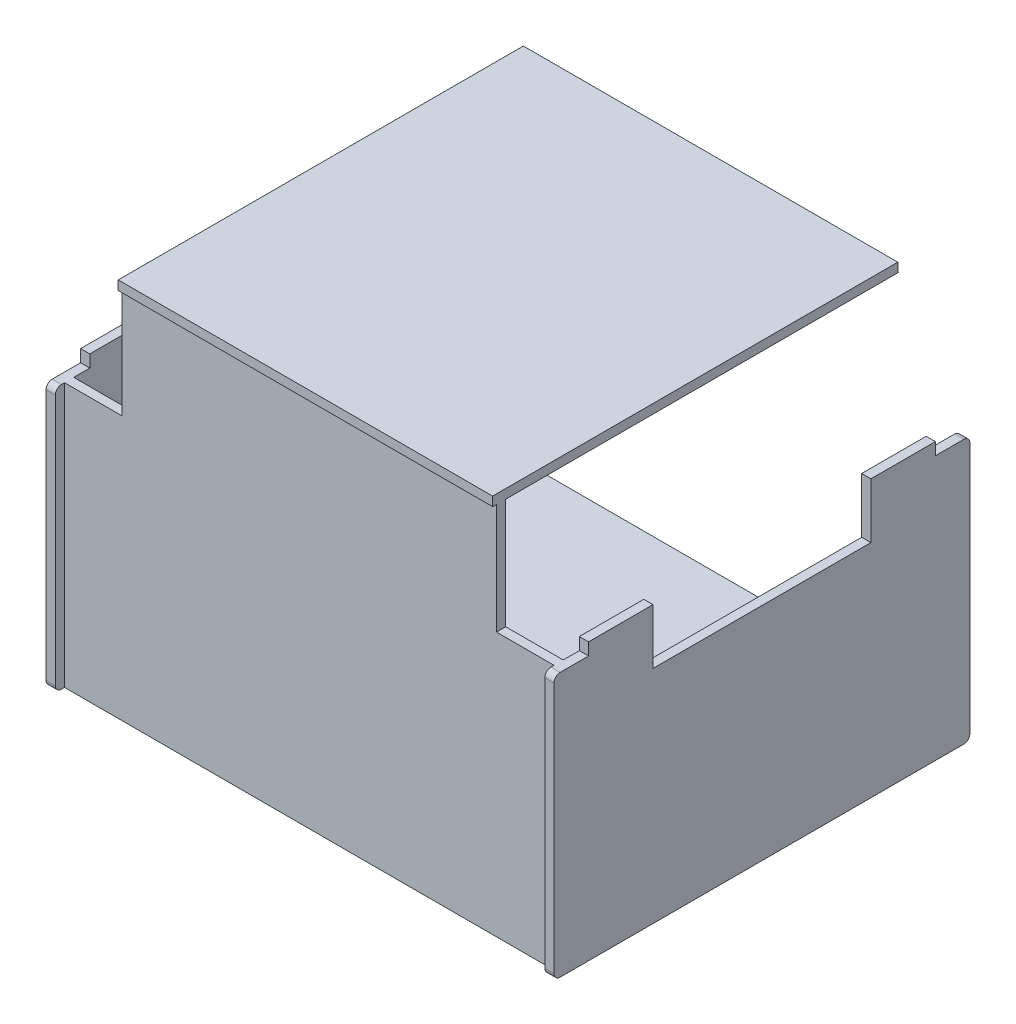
ISO-10303-21;
HEADER;
FILE_DESCRIPTION(('STEP AP214'),'2;1');
FILE_NAME('part.step','',(''),(''),'','','');
FILE_SCHEMA(('AUTOMOTIVE_DESIGN { 1 0 10303 214 1 1 1 1 }'));
ENDSEC;
DATA;
#1=APPLICATION_CONTEXT('core data for automotive mechanical design processes');
#2=APPLICATION_PROTOCOL_DEFINITION('international standard','automotive_design',2000,#1);
#3=PRODUCT_CONTEXT('',#1,'mechanical');
#4=PRODUCT('Part','Part','',(#3));
#5=PRODUCT_RELATED_PRODUCT_CATEGORY('part','',(#4));
#6=PRODUCT_DEFINITION_FORMATION('','',#4);
#7=PRODUCT_DEFINITION_CONTEXT('part definition',#1,'design');
#8=PRODUCT_DEFINITION('design','',#6,#7);
#9=PRODUCT_DEFINITION_SHAPE('','',#8);
#10=(LENGTH_UNIT() NAMED_UNIT(*) SI_UNIT(.MILLI.,.METRE.));
#11=(NAMED_UNIT(*) PLANE_ANGLE_UNIT() SI_UNIT($,.RADIAN.));
#12=(NAMED_UNIT(*) SI_UNIT($,.STERADIAN.) SOLID_ANGLE_UNIT());
#13=UNCERTAINTY_MEASURE_WITH_UNIT(LENGTH_MEASURE(1.E-05),#10,'distance_accuracy_value','');
#14=(GEOMETRIC_REPRESENTATION_CONTEXT(3) GLOBAL_UNCERTAINTY_ASSIGNED_CONTEXT((#13)) GLOBAL_UNIT_ASSIGNED_CONTEXT((#10,
#11,#12)) REPRESENTATION_CONTEXT('',''));
#15=CARTESIAN_POINT('',(0.,0.,0.));
#16=DIRECTION('',(0.,0.,1.));
#17=DIRECTION('',(1.,0.,0.));
#18=AXIS2_PLACEMENT_3D('',#15,#16,#17);
#19=CARTESIAN_POINT('',(-165.5,-78.,135.5));
#20=DIRECTION('',(0.,-1.,0.));
#21=DIRECTION('',(0.,0.,-1.));
#22=AXIS2_PLACEMENT_3D('',#19,#20,#21);
#23=PLANE('',#22);
#24=DIRECTION('',(0.,0.,-1.));
#25=VECTOR('',#24,1.);
#26=CARTESIAN_POINT('',(-159.5,-78.,135.5));
#27=LINE('',#26,#25);
#28=CARTESIAN_POINT('',(-159.5,-78.,-113.));
#29=VERTEX_POINT('',#28);
#30=CARTESIAN_POINT('',(-159.5,-78.,-131.5));
#31=VERTEX_POINT('',#30);
#32=EDGE_CURVE('E367',#29,#31,#27,.T.);
#33=ORIENTED_EDGE('',*,*,#32,.T.);
#34=DIRECTION('',(-1.,0.,0.));
#35=VECTOR('',#34,1.);
#36=CARTESIAN_POINT('',(-165.5,-78.,-131.5));
#37=LINE('',#36,#35);
#38=CARTESIAN_POINT('',(-165.5,-78.,-131.5));
#39=VERTEX_POINT('',#38);
#40=EDGE_CURVE('E338',#31,#39,#37,.T.);
#41=ORIENTED_EDGE('',*,*,#40,.T.);
#42=DIRECTION('',(0.,0.,-1.));
#43=VECTOR('',#42,1.);
#44=CARTESIAN_POINT('',(-165.5,-78.,135.5));
#45=LINE('',#44,#43);
#46=CARTESIAN_POINT('',(-165.5,-78.,-113.));
#47=VERTEX_POINT('',#46);
#48=EDGE_CURVE('E277',#47,#39,#45,.T.);
#49=ORIENTED_EDGE('',*,*,#48,.F.);
#50=DIRECTION('',(-1.,0.,0.));
#51=VECTOR('',#50,1.);
#52=CARTESIAN_POINT('',(-165.5,-78.0000000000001,-113.));
#53=LINE('',#52,#51);
#54=EDGE_CURVE('E597',#29,#47,#53,.T.);
#55=ORIENTED_EDGE('',*,*,#54,.F.);
#56=EDGE_LOOP('',(#33,#41,#49,#55));
#57=FACE_BOUND('',#56,.T.);
#58=ADVANCED_FACE('F35',(#57),#23,.F.);
#59=CARTESIAN_POINT('',(-165.5,-78.,131.5));
#60=VERTEX_POINT('',#59);
#61=CARTESIAN_POINT('',(-165.5,-78.0000000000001,113.));
#62=VERTEX_POINT('',#61);
#63=EDGE_CURVE('E278',#60,#62,#45,.T.);
#64=ORIENTED_EDGE('',*,*,#63,.F.);
#65=DIRECTION('',(-1.,0.,0.));
#66=VECTOR('',#65,1.);
#67=CARTESIAN_POINT('',(-165.5,-78.,131.5));
#68=LINE('',#67,#66);
#69=CARTESIAN_POINT('',(-159.5,-78.,131.5));
#70=VERTEX_POINT('',#69);
#71=EDGE_CURVE('E332',#60,#70,#68,.F.);
#72=ORIENTED_EDGE('',*,*,#71,.T.);
#73=DIRECTION('',(0.,0.,-1.));
#74=VECTOR('',#73,1.);
#75=CARTESIAN_POINT('',(-159.5,-78.,135.5));
#76=LINE('',#75,#74);
#77=CARTESIAN_POINT('',(-159.5,-78.,129.5));
#78=VERTEX_POINT('',#77);
#79=EDGE_CURVE('E456',#70,#78,#76,.T.);
#80=ORIENTED_EDGE('',*,*,#79,.T.);
#81=DIRECTION('',(1.,0.,0.));
#82=VECTOR('',#81,1.);
#83=CARTESIAN_POINT('',(-165.5,-78.,129.5));
#84=LINE('',#83,#82);
#85=CARTESIAN_POINT('',(-122.,-78.,129.5));
#86=VERTEX_POINT('',#85);
#87=EDGE_CURVE('E447',#78,#86,#84,.T.);
#88=ORIENTED_EDGE('',*,*,#87,.T.);
#89=DIRECTION('',(0.,0.,-1.));
#90=VECTOR('',#89,1.);
#91=CARTESIAN_POINT('',(-122.,-78.,135.5));
#92=LINE('',#91,#90);
#93=CARTESIAN_POINT('',(-122.,-78.,123.5));
#94=VERTEX_POINT('',#93);
#95=EDGE_CURVE('E281',#86,#94,#92,.T.);
#96=ORIENTED_EDGE('',*,*,#95,.T.);
#97=DIRECTION('',(-1.,0.,0.));
#98=VECTOR('',#97,1.);
#99=CARTESIAN_POINT('',(0.,-78.,123.5));
#100=LINE('',#99,#98);
#101=CARTESIAN_POINT('',(-159.5,-78.,123.5));
#102=VERTEX_POINT('',#101);
#103=EDGE_CURVE('E379',#94,#102,#100,.T.);
#104=ORIENTED_EDGE('',*,*,#103,.T.);
#105=CARTESIAN_POINT('',(-159.5,-78.0000000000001,113.));
#106=VERTEX_POINT('',#105);
#107=EDGE_CURVE('E363',#102,#106,#27,.T.);
#108=ORIENTED_EDGE('',*,*,#107,.T.);
#109=DIRECTION('',(1.,0.,0.));
#110=VECTOR('',#109,1.);
#111=CARTESIAN_POINT('',(-165.5,-78.0000000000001,113.));
#112=LINE('',#111,#110);
#113=EDGE_CURVE('E576',#62,#106,#112,.T.);
#114=ORIENTED_EDGE('',*,*,#113,.F.);
#115=EDGE_LOOP('',(#64,#72,#80,#88,#96,#104,#108,#114));
#116=FACE_BOUND('',#115,.T.);
#117=ADVANCED_FACE('F800',(#116),#23,.F.);
#118=CARTESIAN_POINT('',(122.,-78.,135.5));
#119=DIRECTION('',(0.,-1.,0.));
#120=DIRECTION('',(1.,0.,0.));
#121=AXIS2_PLACEMENT_3D('',#118,#119,#120);
#122=PLANE('',#121);
#123=DIRECTION('',(0.,0.,-1.));
#124=VECTOR('',#123,1.);
#125=CARTESIAN_POINT('',(165.5,-78.,135.5));
#126=LINE('',#125,#124);
#127=CARTESIAN_POINT('',(165.5,-78.,-113.));
#128=VERTEX_POINT('',#127);
#129=CARTESIAN_POINT('',(165.5,-78.,-131.5));
#130=VERTEX_POINT('',#129);
#131=EDGE_CURVE('E223',#128,#130,#126,.T.);
#132=ORIENTED_EDGE('',*,*,#131,.T.);
#133=DIRECTION('',(-1.,0.,0.));
#134=VECTOR('',#133,1.);
#135=CARTESIAN_POINT('',(159.5,-78.,-131.5));
#136=LINE('',#135,#134);
#137=CARTESIAN_POINT('',(159.5,-78.,-131.5));
#138=VERTEX_POINT('',#137);
#139=EDGE_CURVE('E210',#130,#138,#136,.T.);
#140=ORIENTED_EDGE('',*,*,#139,.T.);
#141=DIRECTION('',(0.,0.,-1.));
#142=VECTOR('',#141,1.);
#143=CARTESIAN_POINT('',(159.5,-78.,135.5));
#144=LINE('',#143,#142);
#145=CARTESIAN_POINT('',(159.5,-78.,-113.));
#146=VERTEX_POINT('',#145);
#147=EDGE_CURVE('E220',#146,#138,#144,.T.);
#148=ORIENTED_EDGE('',*,*,#147,.F.);
#149=DIRECTION('',(-1.,0.,0.));
#150=VECTOR('',#149,1.);
#151=CARTESIAN_POINT('',(165.5,-78.,-113.));
#152=LINE('',#151,#150);
#153=EDGE_CURVE('E556',#128,#146,#152,.T.);
#154=ORIENTED_EDGE('',*,*,#153,.F.);
#155=EDGE_LOOP('',(#132,#140,#148,#154));
#156=FACE_BOUND('',#155,.T.);
#157=ADVANCED_FACE('F219',(#156),#122,.F.);
#158=DIRECTION('',(0.,0.,1.));
#159=VECTOR('',#158,1.);
#160=CARTESIAN_POINT('',(159.5,-78.,135.5));
#161=LINE('',#160,#159);
#162=CARTESIAN_POINT('',(159.5,-78.,129.5));
#163=VERTEX_POINT('',#162);
#164=CARTESIAN_POINT('',(159.5,-78.,131.5));
#165=VERTEX_POINT('',#164);
#166=EDGE_CURVE('E459',#163,#165,#161,.T.);
#167=ORIENTED_EDGE('',*,*,#166,.T.);
#168=DIRECTION('',(-1.,0.,0.));
#169=VECTOR('',#168,1.);
#170=CARTESIAN_POINT('',(122.,-78.,131.5));
#171=LINE('',#170,#169);
#172=CARTESIAN_POINT('',(165.5,-78.,131.5));
#173=VERTEX_POINT('',#172);
#174=EDGE_CURVE('E308',#165,#173,#171,.F.);
#175=ORIENTED_EDGE('',*,*,#174,.T.);
#176=CARTESIAN_POINT('',(165.5,-78.,113.));
#177=VERTEX_POINT('',#176);
#178=EDGE_CURVE('E268',#173,#177,#126,.T.);
#179=ORIENTED_EDGE('',*,*,#178,.T.);
#180=DIRECTION('',(1.,0.,0.));
#181=VECTOR('',#180,1.);
#182=CARTESIAN_POINT('',(165.5,-78.,113.));
#183=LINE('',#182,#181);
#184=CARTESIAN_POINT('',(159.5,-78.,113.));
#185=VERTEX_POINT('',#184);
#186=EDGE_CURVE('E537',#185,#177,#183,.T.);
#187=ORIENTED_EDGE('',*,*,#186,.F.);
#188=CARTESIAN_POINT('',(159.5,-78.,123.5));
#189=VERTEX_POINT('',#188);
#190=EDGE_CURVE('E231',#189,#185,#144,.T.);
#191=ORIENTED_EDGE('',*,*,#190,.F.);
#192=DIRECTION('',(-1.,0.,0.));
#193=VECTOR('',#192,1.);
#194=CARTESIAN_POINT('',(0.,-78.,123.5));
#195=LINE('',#194,#193);
#196=CARTESIAN_POINT('',(122.,-78.,123.5));
#197=VERTEX_POINT('',#196);
#198=EDGE_CURVE('E238',#189,#197,#195,.T.);
#199=ORIENTED_EDGE('',*,*,#198,.T.);
#200=DIRECTION('',(0.,0.,-1.));
#201=VECTOR('',#200,1.);
#202=CARTESIAN_POINT('',(122.,-78.,135.5));
#203=LINE('',#202,#201);
#204=CARTESIAN_POINT('',(122.,-78.,129.5));
#205=VERTEX_POINT('',#204);
#206=EDGE_CURVE('E265',#205,#197,#203,.T.);
#207=ORIENTED_EDGE('',*,*,#206,.F.);
#208=DIRECTION('',(1.,0.,0.));
#209=VECTOR('',#208,1.);
#210=CARTESIAN_POINT('',(122.,-78.,129.5));
#211=LINE('',#210,#209);
#212=EDGE_CURVE('E450',#205,#163,#211,.T.);
#213=ORIENTED_EDGE('',*,*,#212,.T.);
#214=EDGE_LOOP('',(#167,#175,#179,#187,#191,#199,#207,#213));
#215=FACE_BOUND('',#214,.T.);
#216=ADVANCED_FACE('F755',(#215),#122,.F.);
#217=CARTESIAN_POINT('',(-159.5,0.,129.5));
#218=DIRECTION('',(0.,0.,-1.));
#219=DIRECTION('',(-1.,0.,0.));
#220=AXIS2_PLACEMENT_3D('',#217,#218,#219);
#221=PLANE('',#220);
#222=DIRECTION('',(1.,0.,0.));
#223=VECTOR('',#222,1.);
#224=CARTESIAN_POINT('',(-122.,-5.99999999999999,129.5));
#225=LINE('',#224,#223);
#226=CARTESIAN_POINT('',(-122.,-5.99999999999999,129.5));
#227=VERTEX_POINT('',#226);
#228=CARTESIAN_POINT('',(122.,-5.99999999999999,129.5));
#229=VERTEX_POINT('',#228);
#230=EDGE_CURVE('E484',#227,#229,#225,.T.);
#231=ORIENTED_EDGE('',*,*,#230,.F.);
#232=DIRECTION('',(0.,1.,0.));
#233=VECTOR('',#232,1.);
#234=CARTESIAN_POINT('',(-122.,-78.,129.5));
#235=LINE('',#234,#233);
#236=EDGE_CURVE('E436',#86,#227,#235,.T.);
#237=ORIENTED_EDGE('',*,*,#236,.F.);
#238=ORIENTED_EDGE('',*,*,#87,.F.);
#239=DIRECTION('',(0.,-1.,0.));
#240=VECTOR('',#239,1.);
#241=CARTESIAN_POINT('',(-159.5,0.,129.5));
#242=LINE('',#241,#240);
#243=CARTESIAN_POINT('',(-159.5,-250.,129.5));
#244=VERTEX_POINT('',#243);
#245=EDGE_CURVE('E463',#78,#244,#242,.T.);
#246=ORIENTED_EDGE('',*,*,#245,.T.);
#247=DIRECTION('',(1.,0.,0.));
#248=VECTOR('',#247,1.);
#249=CARTESIAN_POINT('',(-159.5,-250.,129.5));
#250=LINE('',#249,#248);
#251=CARTESIAN_POINT('',(159.5,-250.,129.5));
#252=VERTEX_POINT('',#251);
#253=EDGE_CURVE('E471',#244,#252,#250,.T.);
#254=ORIENTED_EDGE('',*,*,#253,.T.);
#255=DIRECTION('',(0.,-1.,0.));
#256=VECTOR('',#255,1.);
#257=CARTESIAN_POINT('',(159.5,0.,129.5));
#258=LINE('',#257,#256);
#259=EDGE_CURVE('E462',#163,#252,#258,.T.);
#260=ORIENTED_EDGE('',*,*,#259,.F.);
#261=ORIENTED_EDGE('',*,*,#212,.F.);
#262=DIRECTION('',(0.,-1.,0.));
#263=VECTOR('',#262,1.);
#264=CARTESIAN_POINT('',(122.,0.,129.5));
#265=LINE('',#264,#263);
#266=EDGE_CURVE('E453',#229,#205,#265,.T.);
#267=ORIENTED_EDGE('',*,*,#266,.F.);
#268=EDGE_LOOP('',(#231,#237,#238,#246,#254,#260,#261,#267));
#269=FACE_BOUND('',#268,.T.);
#270=ADVANCED_FACE('F753',(#269),#221,.F.);
#271=CARTESIAN_POINT('',(0.,0.,135.5));
#272=DIRECTION('',(0.,0.,-1.));
#273=DIRECTION('',(-1.,0.,0.));
#274=AXIS2_PLACEMENT_3D('',#271,#272,#273);
#275=PLANE('',#274);
#276=DIRECTION('',(0.,1.,0.));
#277=VECTOR('',#276,1.);
#278=CARTESIAN_POINT('',(-159.5,0.,135.5));
#279=LINE('',#278,#277);
#280=CARTESIAN_POINT('',(-159.5,-246.,135.5));
#281=VERTEX_POINT('',#280);
#282=CARTESIAN_POINT('',(-159.5,-82.,135.5));
#283=VERTEX_POINT('',#282);
#284=EDGE_CURVE('E295',#281,#283,#279,.T.);
#285=ORIENTED_EDGE('',*,*,#284,.T.);
#286=DIRECTION('',(-1.,0.,0.));
#287=VECTOR('',#286,1.);
#288=CARTESIAN_POINT('',(0.,-82.,135.5));
#289=LINE('',#288,#287);
#290=CARTESIAN_POINT('',(-165.5,-82.,135.5));
#291=VERTEX_POINT('',#290);
#292=EDGE_CURVE('E321',#283,#291,#289,.T.);
#293=ORIENTED_EDGE('',*,*,#292,.T.);
#294=DIRECTION('',(0.,-1.,0.));
#295=VECTOR('',#294,1.);
#296=CARTESIAN_POINT('',(-165.5,-250.,135.5));
#297=LINE('',#296,#295);
#298=CARTESIAN_POINT('',(-165.5,-246.,135.5));
#299=VERTEX_POINT('',#298);
#300=EDGE_CURVE('E246',#291,#299,#297,.T.);
#301=ORIENTED_EDGE('',*,*,#300,.T.);
#302=DIRECTION('',(1.,0.,0.));
#303=VECTOR('',#302,1.);
#304=CARTESIAN_POINT('',(0.,-246.,135.5));
#305=LINE('',#304,#303);
#306=EDGE_CURVE('E318',#299,#281,#305,.T.);
#307=ORIENTED_EDGE('',*,*,#306,.T.);
#308=EDGE_LOOP('',(#285,#293,#301,#307));
#309=FACE_BOUND('',#308,.T.);
#310=ADVANCED_FACE('F812',(#309),#275,.F.);
#311=CARTESIAN_POINT('',(-165.5,-250.,135.5));
#312=DIRECTION('',(1.,0.,0.));
#313=DIRECTION('',(0.,0.,-1.));
#314=AXIS2_PLACEMENT_3D('',#311,#312,#313);
#315=PLANE('',#314);
#316=ORIENTED_EDGE('',*,*,#300,.F.);
#317=CARTESIAN_POINT('',(-165.5,-82.,131.5));
#318=DIRECTION('',(1.,0.,0.));
#319=DIRECTION('',(0.,0.,-1.));
#320=AXIS2_PLACEMENT_3D('',#317,#318,#319);
#321=CIRCLE('',#320,4.);
#322=EDGE_CURVE('E330',#291,#60,#321,.F.);
#323=ORIENTED_EDGE('',*,*,#322,.T.);
#324=ORIENTED_EDGE('',*,*,#63,.T.);
#325=DIRECTION('',(0.,-1.,0.));
#326=VECTOR('',#325,1.);
#327=CARTESIAN_POINT('',(-165.5,-70.0000000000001,113.));
#328=LINE('',#327,#326);
#329=CARTESIAN_POINT('',(-165.5,-70.0000000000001,113.));
#330=VERTEX_POINT('',#329);
#331=EDGE_CURVE('E559',#330,#62,#328,.T.);
#332=ORIENTED_EDGE('',*,*,#331,.F.);
#333=DIRECTION('',(0.,0.,1.));
#334=VECTOR('',#333,1.);
#335=CARTESIAN_POINT('',(-165.5,-70.0000000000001,71.));
#336=LINE('',#335,#334);
#337=CARTESIAN_POINT('',(-165.5,-70.0000000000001,71.));
#338=VERTEX_POINT('',#337);
#339=EDGE_CURVE('E579',#338,#330,#336,.T.);
#340=ORIENTED_EDGE('',*,*,#339,.F.);
#341=DIRECTION('',(0.,-1.,0.));
#342=VECTOR('',#341,1.);
#343=CARTESIAN_POINT('',(-165.5,-78.0000000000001,71.));
#344=LINE('',#343,#342);
#345=CARTESIAN_POINT('',(-165.5,-106.,71.));
#346=VERTEX_POINT('',#345);
#347=EDGE_CURVE('E437',#338,#346,#344,.T.);
#348=ORIENTED_EDGE('',*,*,#347,.T.);
#349=DIRECTION('',(0.,0.,-1.));
#350=VECTOR('',#349,1.);
#351=CARTESIAN_POINT('',(-165.5,-106.,71.));
#352=LINE('',#351,#350);
#353=CARTESIAN_POINT('',(-165.5,-106.,-71.));
#354=VERTEX_POINT('',#353);
#355=EDGE_CURVE('E440',#346,#354,#352,.T.);
#356=ORIENTED_EDGE('',*,*,#355,.T.);
#357=DIRECTION('',(0.,-1.,0.));
#358=VECTOR('',#357,1.);
#359=CARTESIAN_POINT('',(-165.5,-78.0000000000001,-71.));
#360=LINE('',#359,#358);
#361=CARTESIAN_POINT('',(-165.5,-70.0000000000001,-71.));
#362=VERTEX_POINT('',#361);
#363=EDGE_CURVE('E429',#362,#354,#360,.T.);
#364=ORIENTED_EDGE('',*,*,#363,.F.);
#365=DIRECTION('',(0.,0.,1.));
#366=VECTOR('',#365,1.);
#367=CARTESIAN_POINT('',(-165.5,-70.0000000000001,-71.));
#368=LINE('',#367,#366);
#369=CARTESIAN_POINT('',(-165.5,-70.0000000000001,-113.));
#370=VERTEX_POINT('',#369);
#371=EDGE_CURVE('E600',#370,#362,#368,.T.);
#372=ORIENTED_EDGE('',*,*,#371,.F.);
#373=DIRECTION('',(0.,-1.,0.));
#374=VECTOR('',#373,1.);
#375=CARTESIAN_POINT('',(-165.5,-70.0000000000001,-113.));
#376=LINE('',#375,#374);
#377=EDGE_CURVE('E593',#370,#47,#376,.T.);
#378=ORIENTED_EDGE('',*,*,#377,.T.);
#379=ORIENTED_EDGE('',*,*,#48,.T.);
#380=CARTESIAN_POINT('',(-165.5,-82.,-131.5));
#381=DIRECTION('',(1.,0.,0.));
#382=DIRECTION('',(0.,0.,-1.));
#383=AXIS2_PLACEMENT_3D('',#380,#381,#382);
#384=CIRCLE('',#383,4.);
#385=CARTESIAN_POINT('',(-165.5,-82.,-135.5));
#386=VERTEX_POINT('',#385);
#387=EDGE_CURVE('E328',#39,#386,#384,.F.);
#388=ORIENTED_EDGE('',*,*,#387,.T.);
#389=DIRECTION('',(0.,-1.,0.));
#390=VECTOR('',#389,1.);
#391=CARTESIAN_POINT('',(-165.5,-250.,-135.5));
#392=LINE('',#391,#390);
#393=CARTESIAN_POINT('',(-165.5,-246.,-135.5));
#394=VERTEX_POINT('',#393);
#395=EDGE_CURVE('E254',#386,#394,#392,.T.);
#396=ORIENTED_EDGE('',*,*,#395,.T.);
#397=CARTESIAN_POINT('',(-165.5,-246.,-131.5));
#398=DIRECTION('',(1.,0.,0.));
#399=DIRECTION('',(0.,0.,-1.));
#400=AXIS2_PLACEMENT_3D('',#397,#398,#399);
#401=CIRCLE('',#400,4.);
#402=CARTESIAN_POINT('',(-165.5,-250.,-131.5));
#403=VERTEX_POINT('',#402);
#404=EDGE_CURVE('E326',#394,#403,#401,.F.);
#405=ORIENTED_EDGE('',*,*,#404,.T.);
#406=DIRECTION('',(0.,0.,-1.));
#407=VECTOR('',#406,1.);
#408=CARTESIAN_POINT('',(-165.5,-250.,135.5));
#409=LINE('',#408,#407);
#410=CARTESIAN_POINT('',(-165.5,-250.,131.5));
#411=VERTEX_POINT('',#410);
#412=EDGE_CURVE('E274',#411,#403,#409,.T.);
#413=ORIENTED_EDGE('',*,*,#412,.F.);
#414=CARTESIAN_POINT('',(-165.5,-246.,131.5));
#415=DIRECTION('',(1.,0.,0.));
#416=DIRECTION('',(0.,0.,-1.));
#417=AXIS2_PLACEMENT_3D('',#414,#415,#416);
#418=CIRCLE('',#417,4.);
#419=EDGE_CURVE('E324',#411,#299,#418,.F.);
#420=ORIENTED_EDGE('',*,*,#419,.T.);
#421=EDGE_LOOP('',(#316,#323,#324,#332,#340,#348,#356,#364,#372,#378,#379,#388,#396,#405,#413,#420));
#422=FACE_BOUND('',#421,.T.);
#423=ADVANCED_FACE('F624',(#422),#315,.F.);
#424=CARTESIAN_POINT('',(165.5,-78.,135.5));
#425=DIRECTION('',(-1.,0.,0.));
#426=DIRECTION('',(0.,-1.,0.));
#427=AXIS2_PLACEMENT_3D('',#424,#425,#426);
#428=PLANE('',#427);
#429=ORIENTED_EDGE('',*,*,#178,.F.);
#430=CARTESIAN_POINT('',(165.5,-82.,131.5));
#431=DIRECTION('',(-1.,0.,0.));
#432=DIRECTION('',(0.,-1.,0.));
#433=AXIS2_PLACEMENT_3D('',#430,#431,#432);
#434=CIRCLE('',#433,4.);
#435=CARTESIAN_POINT('',(165.5,-82.,135.5));
#436=VERTEX_POINT('',#435);
#437=EDGE_CURVE('E316',#173,#436,#434,.F.);
#438=ORIENTED_EDGE('',*,*,#437,.T.);
#439=DIRECTION('',(0.,1.,0.));
#440=VECTOR('',#439,1.);
#441=CARTESIAN_POINT('',(165.5,-78.,135.5));
#442=LINE('',#441,#440);
#443=CARTESIAN_POINT('',(165.5,-246.,135.5));
#444=VERTEX_POINT('',#443);
#445=EDGE_CURVE('E249',#444,#436,#442,.T.);
#446=ORIENTED_EDGE('',*,*,#445,.F.);
#447=CARTESIAN_POINT('',(165.5,-246.,131.5));
#448=DIRECTION('',(-1.,0.,0.));
#449=DIRECTION('',(0.,-1.,0.));
#450=AXIS2_PLACEMENT_3D('',#447,#448,#449);
#451=CIRCLE('',#450,4.);
#452=CARTESIAN_POINT('',(165.5,-250.,131.5));
#453=VERTEX_POINT('',#452);
#454=EDGE_CURVE('E310',#444,#453,#451,.F.);
#455=ORIENTED_EDGE('',*,*,#454,.T.);
#456=DIRECTION('',(0.,0.,-1.));
#457=VECTOR('',#456,1.);
#458=CARTESIAN_POINT('',(165.5,-250.,135.5));
#459=LINE('',#458,#457);
#460=CARTESIAN_POINT('',(165.5,-250.,-131.5));
#461=VERTEX_POINT('',#460);
#462=EDGE_CURVE('E271',#453,#461,#459,.T.);
#463=ORIENTED_EDGE('',*,*,#462,.T.);
#464=CARTESIAN_POINT('',(165.5,-246.,-131.5));
#465=DIRECTION('',(-1.,0.,0.));
#466=DIRECTION('',(0.,-1.,0.));
#467=AXIS2_PLACEMENT_3D('',#464,#465,#466);
#468=CIRCLE('',#467,4.);
#469=CARTESIAN_POINT('',(165.5,-246.,-135.5));
#470=VERTEX_POINT('',#469);
#471=EDGE_CURVE('E312',#461,#470,#468,.F.);
#472=ORIENTED_EDGE('',*,*,#471,.T.);
#473=DIRECTION('',(0.,1.,0.));
#474=VECTOR('',#473,1.);
#475=CARTESIAN_POINT('',(165.5,-78.,-135.5));
#476=LINE('',#475,#474);
#477=CARTESIAN_POINT('',(165.5,-82.,-135.5));
#478=VERTEX_POINT('',#477);
#479=EDGE_CURVE('E257',#470,#478,#476,.T.);
#480=ORIENTED_EDGE('',*,*,#479,.T.);
#481=CARTESIAN_POINT('',(165.5,-82.,-131.5));
#482=DIRECTION('',(-1.,0.,0.));
#483=DIRECTION('',(0.,-1.,0.));
#484=AXIS2_PLACEMENT_3D('',#481,#482,#483);
#485=CIRCLE('',#484,4.);
#486=EDGE_CURVE('E314',#478,#130,#485,.F.);
#487=ORIENTED_EDGE('',*,*,#486,.T.);
#488=ORIENTED_EDGE('',*,*,#131,.F.);
#489=DIRECTION('',(0.,-1.,0.));
#490=VECTOR('',#489,1.);
#491=CARTESIAN_POINT('',(165.5,-70.,-113.));
#492=LINE('',#491,#490);
#493=CARTESIAN_POINT('',(165.5,-70.,-113.));
#494=VERTEX_POINT('',#493);
#495=EDGE_CURVE('E541',#494,#128,#492,.T.);
#496=ORIENTED_EDGE('',*,*,#495,.F.);
#497=DIRECTION('',(0.,0.,-1.));
#498=VECTOR('',#497,1.);
#499=CARTESIAN_POINT('',(165.5,-70.,-71.));
#500=LINE('',#499,#498);
#501=CARTESIAN_POINT('',(165.5,-70.,-71.));
#502=VERTEX_POINT('',#501);
#503=EDGE_CURVE('E558',#502,#494,#500,.T.);
#504=ORIENTED_EDGE('',*,*,#503,.F.);
#505=DIRECTION('',(0.,-1.,0.));
#506=VECTOR('',#505,1.);
#507=CARTESIAN_POINT('',(165.5,-78.,-71.));
#508=LINE('',#507,#506);
#509=CARTESIAN_POINT('',(165.5,-106.,-71.));
#510=VERTEX_POINT('',#509);
#511=EDGE_CURVE('E433',#502,#510,#508,.T.);
#512=ORIENTED_EDGE('',*,*,#511,.T.);
#513=DIRECTION('',(0.,0.,-1.));
#514=VECTOR('',#513,1.);
#515=CARTESIAN_POINT('',(165.5,-106.,71.));
#516=LINE('',#515,#514);
#517=CARTESIAN_POINT('',(165.5,-106.,71.));
#518=VERTEX_POINT('',#517);
#519=EDGE_CURVE('E430',#518,#510,#516,.T.);
#520=ORIENTED_EDGE('',*,*,#519,.F.);
#521=DIRECTION('',(0.,-1.,0.));
#522=VECTOR('',#521,1.);
#523=CARTESIAN_POINT('',(165.5,-78.,71.));
#524=LINE('',#523,#522);
#525=CARTESIAN_POINT('',(165.5,-70.,71.));
#526=VERTEX_POINT('',#525);
#527=EDGE_CURVE('E426',#526,#518,#524,.T.);
#528=ORIENTED_EDGE('',*,*,#527,.F.);
#529=DIRECTION('',(0.,0.,-1.));
#530=VECTOR('',#529,1.);
#531=CARTESIAN_POINT('',(165.5,-70.,71.));
#532=LINE('',#531,#530);
#533=CARTESIAN_POINT('',(165.5,-70.,113.));
#534=VERTEX_POINT('',#533);
#535=EDGE_CURVE('E540',#534,#526,#532,.T.);
#536=ORIENTED_EDGE('',*,*,#535,.F.);
#537=DIRECTION('',(0.,-1.,0.));
#538=VECTOR('',#537,1.);
#539=CARTESIAN_POINT('',(165.5,-70.,113.));
#540=LINE('',#539,#538);
#541=EDGE_CURVE('E533',#534,#177,#540,.T.);
#542=ORIENTED_EDGE('',*,*,#541,.T.);
#543=EDGE_LOOP('',(#429,#438,#446,#455,#463,#472,#480,#487,#488,#496,#504,#512,#520,#528,#536,#542));
#544=FACE_BOUND('',#543,.T.);
#545=ADVANCED_FACE('F765',(#544),#428,.F.);
#546=CARTESIAN_POINT('',(-159.5,-250.,135.5));
#547=DIRECTION('',(1.,0.,0.));
#548=DIRECTION('',(0.,0.,-1.));
#549=AXIS2_PLACEMENT_3D('',#546,#547,#548);
#550=PLANE('',#549);
#551=DIRECTION('',(0.,-1.,0.));
#552=VECTOR('',#551,1.);
#553=CARTESIAN_POINT('',(-159.5,0.,-135.5));
#554=LINE('',#553,#552);
#555=CARTESIAN_POINT('',(-159.5,-82.,-135.5));
#556=VERTEX_POINT('',#555);
#557=CARTESIAN_POINT('',(-159.5,-238.,-135.5));
#558=VERTEX_POINT('',#557);
#559=EDGE_CURVE('E245',#556,#558,#554,.T.);
#560=ORIENTED_EDGE('',*,*,#559,.F.);
#561=CARTESIAN_POINT('',(-159.5,-82.,-131.5));
#562=DIRECTION('',(1.,0.,0.));
#563=DIRECTION('',(0.,0.,-1.));
#564=AXIS2_PLACEMENT_3D('',#561,#562,#563);
#565=CIRCLE('',#564,4.);
#566=EDGE_CURVE('E224',#556,#31,#565,.T.);
#567=ORIENTED_EDGE('',*,*,#566,.T.);
#568=ORIENTED_EDGE('',*,*,#32,.F.);
#569=DIRECTION('',(0.,-1.,0.));
#570=VECTOR('',#569,1.);
#571=CARTESIAN_POINT('',(-159.5,-70.0000000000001,-113.));
#572=LINE('',#571,#570);
#573=CARTESIAN_POINT('',(-159.5,-70.0000000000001,-113.));
#574=VERTEX_POINT('',#573);
#575=EDGE_CURVE('E580',#574,#29,#572,.T.);
#576=ORIENTED_EDGE('',*,*,#575,.F.);
#577=DIRECTION('',(0.,0.,-1.));
#578=VECTOR('',#577,1.);
#579=CARTESIAN_POINT('',(-159.5,-70.0000000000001,-71.));
#580=LINE('',#579,#578);
#581=CARTESIAN_POINT('',(-159.5,-70.0000000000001,-71.));
#582=VERTEX_POINT('',#581);
#583=EDGE_CURVE('E603',#582,#574,#580,.T.);
#584=ORIENTED_EDGE('',*,*,#583,.F.);
#585=DIRECTION('',(0.,-1.,0.));
#586=VECTOR('',#585,1.);
#587=CARTESIAN_POINT('',(-159.5,-250.,-71.));
#588=LINE('',#587,#586);
#589=CARTESIAN_POINT('',(-159.5,-106.,-71.));
#590=VERTEX_POINT('',#589);
#591=EDGE_CURVE('E409',#582,#590,#588,.T.);
#592=ORIENTED_EDGE('',*,*,#591,.T.);
#593=DIRECTION('',(0.,0.,-1.));
#594=VECTOR('',#593,1.);
#595=CARTESIAN_POINT('',(-159.5,-106.,135.5));
#596=LINE('',#595,#594);
#597=CARTESIAN_POINT('',(-159.5,-106.,71.));
#598=VERTEX_POINT('',#597);
#599=EDGE_CURVE('E412',#598,#590,#596,.T.);
#600=ORIENTED_EDGE('',*,*,#599,.F.);
#601=DIRECTION('',(0.,-1.,0.));
#602=VECTOR('',#601,1.);
#603=CARTESIAN_POINT('',(-159.5,-250.,71.));
#604=LINE('',#603,#602);
#605=CARTESIAN_POINT('',(-159.5,-70.0000000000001,71.));
#606=VERTEX_POINT('',#605);
#607=EDGE_CURVE('E415',#606,#598,#604,.T.);
#608=ORIENTED_EDGE('',*,*,#607,.F.);
#609=DIRECTION('',(0.,0.,-1.));
#610=VECTOR('',#609,1.);
#611=CARTESIAN_POINT('',(-159.5,-70.0000000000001,71.));
#612=LINE('',#611,#610);
#613=CARTESIAN_POINT('',(-159.5,-70.0000000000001,113.));
#614=VERTEX_POINT('',#613);
#615=EDGE_CURVE('E583',#614,#606,#612,.T.);
#616=ORIENTED_EDGE('',*,*,#615,.F.);
#617=DIRECTION('',(0.,-1.,0.));
#618=VECTOR('',#617,1.);
#619=CARTESIAN_POINT('',(-159.5,-70.0000000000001,113.));
#620=LINE('',#619,#618);
#621=EDGE_CURVE('E572',#614,#106,#620,.T.);
#622=ORIENTED_EDGE('',*,*,#621,.T.);
#623=ORIENTED_EDGE('',*,*,#107,.F.);
#624=DIRECTION('',(0.,-1.,0.));
#625=VECTOR('',#624,1.);
#626=CARTESIAN_POINT('',(-159.5,0.,123.5));
#627=LINE('',#626,#625);
#628=CARTESIAN_POINT('',(-159.5,-238.,123.5));
#629=VERTEX_POINT('',#628);
#630=EDGE_CURVE('E381',#102,#629,#627,.T.);
#631=ORIENTED_EDGE('',*,*,#630,.T.);
#632=DIRECTION('',(0.,0.,-1.));
#633=VECTOR('',#632,1.);
#634=CARTESIAN_POINT('',(-159.5,-238.,135.5));
#635=LINE('',#634,#633);
#636=EDGE_CURVE('E375',#629,#558,#635,.T.);
#637=ORIENTED_EDGE('',*,*,#636,.T.);
#638=EDGE_LOOP('',(#560,#567,#568,#576,#584,#592,#600,#608,#616,#622,#623,#631,#637));
#639=FACE_BOUND('',#638,.T.);
#640=ADVANCED_FACE('F792',(#639),#550,.T.);
#641=CARTESIAN_POINT('',(159.5,-78.,135.5));
#642=DIRECTION('',(-1.,0.,0.));
#643=DIRECTION('',(0.,-1.,0.));
#644=AXIS2_PLACEMENT_3D('',#641,#642,#643);
#645=PLANE('',#644);
#646=ORIENTED_EDGE('',*,*,#147,.T.);
#647=CARTESIAN_POINT('',(159.5,-82.,-131.5));
#648=DIRECTION('',(-1.,0.,0.));
#649=DIRECTION('',(0.,-1.,0.));
#650=AXIS2_PLACEMENT_3D('',#647,#648,#649);
#651=CIRCLE('',#650,4.);
#652=CARTESIAN_POINT('',(159.5,-82.,-135.5));
#653=VERTEX_POINT('',#652);
#654=EDGE_CURVE('E206',#138,#653,#651,.T.);
#655=ORIENTED_EDGE('',*,*,#654,.T.);
#656=DIRECTION('',(0.,1.,0.));
#657=VECTOR('',#656,1.);
#658=CARTESIAN_POINT('',(159.5,0.,-135.5));
#659=LINE('',#658,#657);
#660=CARTESIAN_POINT('',(159.5,-238.,-135.5));
#661=VERTEX_POINT('',#660);
#662=EDGE_CURVE('E240',#661,#653,#659,.T.);
#663=ORIENTED_EDGE('',*,*,#662,.F.);
#664=DIRECTION('',(0.,0.,-1.));
#665=VECTOR('',#664,1.);
#666=CARTESIAN_POINT('',(159.5,-238.,135.5));
#667=LINE('',#666,#665);
#668=CARTESIAN_POINT('',(159.5,-238.,123.5));
#669=VERTEX_POINT('',#668);
#670=EDGE_CURVE('E89',#669,#661,#667,.T.);
#671=ORIENTED_EDGE('',*,*,#670,.F.);
#672=DIRECTION('',(0.,1.,0.));
#673=VECTOR('',#672,1.);
#674=CARTESIAN_POINT('',(159.5,0.,123.5));
#675=LINE('',#674,#673);
#676=EDGE_CURVE('E392',#669,#189,#675,.T.);
#677=ORIENTED_EDGE('',*,*,#676,.T.);
#678=ORIENTED_EDGE('',*,*,#190,.T.);
#679=DIRECTION('',(0.,-1.,0.));
#680=VECTOR('',#679,1.);
#681=CARTESIAN_POINT('',(159.5,-70.,113.));
#682=LINE('',#681,#680);
#683=CARTESIAN_POINT('',(159.5,-70.,113.));
#684=VERTEX_POINT('',#683);
#685=EDGE_CURVE('E523',#684,#185,#682,.T.);
#686=ORIENTED_EDGE('',*,*,#685,.F.);
#687=DIRECTION('',(0.,0.,1.));
#688=VECTOR('',#687,1.);
#689=CARTESIAN_POINT('',(159.5,-70.,71.));
#690=LINE('',#689,#688);
#691=CARTESIAN_POINT('',(159.5,-70.,71.));
#692=VERTEX_POINT('',#691);
#693=EDGE_CURVE('E544',#692,#684,#690,.T.);
#694=ORIENTED_EDGE('',*,*,#693,.F.);
#695=DIRECTION('',(0.,1.,0.));
#696=VECTOR('',#695,1.);
#697=CARTESIAN_POINT('',(159.5,-78.,71.));
#698=LINE('',#697,#696);
#699=CARTESIAN_POINT('',(159.5,-106.,71.));
#700=VERTEX_POINT('',#699);
#701=EDGE_CURVE('E283',#700,#692,#698,.T.);
#702=ORIENTED_EDGE('',*,*,#701,.F.);
#703=DIRECTION('',(0.,0.,1.));
#704=VECTOR('',#703,1.);
#705=CARTESIAN_POINT('',(159.5,-106.,135.5));
#706=LINE('',#705,#704);
#707=CARTESIAN_POINT('',(159.5,-106.,-71.));
#708=VERTEX_POINT('',#707);
#709=EDGE_CURVE('E286',#708,#700,#706,.T.);
#710=ORIENTED_EDGE('',*,*,#709,.F.);
#711=DIRECTION('',(0.,1.,0.));
#712=VECTOR('',#711,1.);
#713=CARTESIAN_POINT('',(159.5,-78.,-71.));
#714=LINE('',#713,#712);
#715=CARTESIAN_POINT('',(159.5,-70.,-71.));
#716=VERTEX_POINT('',#715);
#717=EDGE_CURVE('E289',#708,#716,#714,.T.);
#718=ORIENTED_EDGE('',*,*,#717,.T.);
#719=DIRECTION('',(0.,0.,1.));
#720=VECTOR('',#719,1.);
#721=CARTESIAN_POINT('',(159.5,-70.,-71.));
#722=LINE('',#721,#720);
#723=CARTESIAN_POINT('',(159.5,-70.,-113.));
#724=VERTEX_POINT('',#723);
#725=EDGE_CURVE('E562',#724,#716,#722,.T.);
#726=ORIENTED_EDGE('',*,*,#725,.F.);
#727=DIRECTION('',(0.,-1.,0.));
#728=VECTOR('',#727,1.);
#729=CARTESIAN_POINT('',(159.5,-70.,-113.));
#730=LINE('',#729,#728);
#731=EDGE_CURVE('E230',#724,#146,#730,.T.);
#732=ORIENTED_EDGE('',*,*,#731,.T.);
#733=EDGE_LOOP('',(#646,#655,#663,#671,#677,#678,#686,#694,#702,#710,#718,#726,#732));
#734=FACE_BOUND('',#733,.T.);
#735=ADVANCED_FACE('F227',(#734),#645,.T.);
#736=CARTESIAN_POINT('',(0.,0.,-132.));
#737=DIRECTION('',(0.,0.,-1.));
#738=DIRECTION('',(-1.,0.,0.));
#739=AXIS2_PLACEMENT_3D('',#736,#737,#738);
#740=PLANE('',#739);
#741=DIRECTION('',(0.,1.,0.));
#742=VECTOR('',#741,1.);
#743=CARTESIAN_POINT('',(122.,0.,-132.));
#744=LINE('',#743,#742);
#745=CARTESIAN_POINT('',(122.,-5.99999999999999,-132.));
#746=VERTEX_POINT('',#745);
#747=CARTESIAN_POINT('',(122.,0.,-132.));
#748=VERTEX_POINT('',#747);
#749=EDGE_CURVE('E261',#746,#748,#744,.T.);
#750=ORIENTED_EDGE('',*,*,#749,.F.);
#751=DIRECTION('',(-1.,0.,0.));
#752=VECTOR('',#751,1.);
#753=CARTESIAN_POINT('',(0.,-5.99999999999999,-132.));
#754=LINE('',#753,#752);
#755=CARTESIAN_POINT('',(-122.,-5.99999999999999,-132.));
#756=VERTEX_POINT('',#755);
#757=EDGE_CURVE('E39',#746,#756,#754,.T.);
#758=ORIENTED_EDGE('',*,*,#757,.T.);
#759=DIRECTION('',(0.,-1.,0.));
#760=VECTOR('',#759,1.);
#761=CARTESIAN_POINT('',(-122.,0.,-132.));
#762=LINE('',#761,#760);
#763=CARTESIAN_POINT('',(-122.,0.,-132.));
#764=VERTEX_POINT('',#763);
#765=EDGE_CURVE('E258',#764,#756,#762,.T.);
#766=ORIENTED_EDGE('',*,*,#765,.F.);
#767=DIRECTION('',(-1.,0.,0.));
#768=VECTOR('',#767,1.);
#769=CARTESIAN_POINT('',(0.,0.,-132.));
#770=LINE('',#769,#768);
#771=EDGE_CURVE('E250',#748,#764,#770,.T.);
#772=ORIENTED_EDGE('',*,*,#771,.F.);
#773=EDGE_LOOP('',(#750,#758,#766,#772));
#774=FACE_BOUND('',#773,.T.);
#775=ADVANCED_FACE('F37',(#774),#740,.T.);
#776=CARTESIAN_POINT('',(0.,0.,-135.5));
#777=DIRECTION('',(0.,0.,-1.));
#778=DIRECTION('',(-1.,0.,0.));
#779=AXIS2_PLACEMENT_3D('',#776,#777,#778);
#780=PLANE('',#779);
#781=ORIENTED_EDGE('',*,*,#395,.F.);
#782=DIRECTION('',(-1.,0.,0.));
#783=VECTOR('',#782,1.);
#784=CARTESIAN_POINT('',(-159.5,-82.,-135.5));
#785=LINE('',#784,#783);
#786=EDGE_CURVE('E346',#386,#556,#785,.F.);
#787=ORIENTED_EDGE('',*,*,#786,.T.);
#788=ORIENTED_EDGE('',*,*,#559,.T.);
#789=DIRECTION('',(1.,0.,0.));
#790=VECTOR('',#789,1.);
#791=CARTESIAN_POINT('',(0.,-238.,-135.5));
#792=LINE('',#791,#790);
#793=EDGE_CURVE('E242',#558,#661,#792,.T.);
#794=ORIENTED_EDGE('',*,*,#793,.T.);
#795=ORIENTED_EDGE('',*,*,#662,.T.);
#796=DIRECTION('',(-1.,0.,0.));
#797=VECTOR('',#796,1.);
#798=CARTESIAN_POINT('',(165.5,-82.,-135.5));
#799=LINE('',#798,#797);
#800=EDGE_CURVE('E211',#653,#478,#799,.F.);
#801=ORIENTED_EDGE('',*,*,#800,.T.);
#802=ORIENTED_EDGE('',*,*,#479,.F.);
#803=DIRECTION('',(1.,0.,0.));
#804=VECTOR('',#803,1.);
#805=CARTESIAN_POINT('',(159.5,-246.,-135.5));
#806=LINE('',#805,#804);
#807=CARTESIAN_POINT('',(159.5,-246.,-135.5));
#808=VERTEX_POINT('',#807);
#809=EDGE_CURVE('E343',#470,#808,#806,.F.);
#810=ORIENTED_EDGE('',*,*,#809,.T.);
#811=DIRECTION('',(0.,1.,0.));
#812=VECTOR('',#811,1.);
#813=CARTESIAN_POINT('',(159.5,-250.,-135.5));
#814=LINE('',#813,#812);
#815=CARTESIAN_POINT('',(159.5,-244.,-135.5));
#816=VERTEX_POINT('',#815);
#817=EDGE_CURVE('E526',#808,#816,#814,.T.);
#818=ORIENTED_EDGE('',*,*,#817,.T.);
#819=DIRECTION('',(-1.,0.,0.));
#820=VECTOR('',#819,1.);
#821=CARTESIAN_POINT('',(-159.5,-244.,-135.5));
#822=LINE('',#821,#820);
#823=CARTESIAN_POINT('',(-159.5,-244.,-135.5));
#824=VERTEX_POINT('',#823);
#825=EDGE_CURVE('E503',#816,#824,#822,.T.);
#826=ORIENTED_EDGE('',*,*,#825,.T.);
#827=DIRECTION('',(0.,-1.,0.));
#828=VECTOR('',#827,1.);
#829=CARTESIAN_POINT('',(-159.5,-250.,-135.5));
#830=LINE('',#829,#828);
#831=CARTESIAN_POINT('',(-159.5,-246.,-135.5));
#832=VERTEX_POINT('',#831);
#833=EDGE_CURVE('E513',#824,#832,#830,.T.);
#834=ORIENTED_EDGE('',*,*,#833,.T.);
#835=DIRECTION('',(1.,0.,0.));
#836=VECTOR('',#835,1.);
#837=CARTESIAN_POINT('',(-165.5,-246.,-135.5));
#838=LINE('',#837,#836);
#839=EDGE_CURVE('E341',#832,#394,#838,.F.);
#840=ORIENTED_EDGE('',*,*,#839,.T.);
#841=EDGE_LOOP('',(#781,#787,#788,#794,#795,#801,#802,#810,#818,#826,#834,#840));
#842=FACE_BOUND('',#841,.T.);
#843=ADVANCED_FACE('F785',(#842),#780,.T.);
#844=CARTESIAN_POINT('',(-122.,-78.,135.5));
#845=DIRECTION('',(1.,0.,0.));
#846=DIRECTION('',(0.,0.,-1.));
#847=AXIS2_PLACEMENT_3D('',#844,#845,#846);
#848=PLANE('',#847);
#849=ORIENTED_EDGE('',*,*,#95,.F.);
#850=ORIENTED_EDGE('',*,*,#236,.T.);
#851=DIRECTION('',(0.,0.,-1.));
#852=VECTOR('',#851,1.);
#853=CARTESIAN_POINT('',(-122.,-5.99999999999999,132.));
#854=LINE('',#853,#852);
#855=CARTESIAN_POINT('',(-122.,-5.99999999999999,132.));
#856=VERTEX_POINT('',#855);
#857=EDGE_CURVE('E477',#856,#227,#854,.T.);
#858=ORIENTED_EDGE('',*,*,#857,.F.);
#859=DIRECTION('',(0.,-1.,0.));
#860=VECTOR('',#859,1.);
#861=CARTESIAN_POINT('',(-122.,0.,132.));
#862=LINE('',#861,#860);
#863=CARTESIAN_POINT('',(-122.,0.,132.));
#864=VERTEX_POINT('',#863);
#865=EDGE_CURVE('E487',#864,#856,#862,.T.);
#866=ORIENTED_EDGE('',*,*,#865,.F.);
#867=DIRECTION('',(0.,0.,-1.));
#868=VECTOR('',#867,1.);
#869=CARTESIAN_POINT('',(-122.,0.,135.5));
#870=LINE('',#869,#868);
#871=EDGE_CURVE('E253',#864,#764,#870,.T.);
#872=ORIENTED_EDGE('',*,*,#871,.T.);
#873=ORIENTED_EDGE('',*,*,#765,.T.);
#874=DIRECTION('',(0.,0.,-1.));
#875=VECTOR('',#874,1.);
#876=CARTESIAN_POINT('',(-122.,-5.99999999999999,135.5));
#877=LINE('',#876,#875);
#878=CARTESIAN_POINT('',(-122.,-5.99999999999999,123.5));
#879=VERTEX_POINT('',#878);
#880=EDGE_CURVE('E74',#879,#756,#877,.T.);
#881=ORIENTED_EDGE('',*,*,#880,.F.);
#882=DIRECTION('',(0.,-1.,0.));
#883=VECTOR('',#882,1.);
#884=CARTESIAN_POINT('',(-122.,0.,123.5));
#885=LINE('',#884,#883);
#886=EDGE_CURVE('E382',#879,#94,#885,.T.);
#887=ORIENTED_EDGE('',*,*,#886,.T.);
#888=EDGE_LOOP('',(#849,#850,#858,#866,#872,#873,#881,#887));
#889=FACE_BOUND('',#888,.T.);
#890=ADVANCED_FACE('F823',(#889),#848,.F.);
#891=CARTESIAN_POINT('',(165.5,-250.,135.5));
#892=DIRECTION('',(0.,1.,0.));
#893=DIRECTION('',(-1.,0.,0.));
#894=AXIS2_PLACEMENT_3D('',#891,#892,#893);
#895=PLANE('',#894);
#896=DIRECTION('',(0.,0.,1.));
#897=VECTOR('',#896,1.);
#898=CARTESIAN_POINT('',(159.5,-250.,-135.5));
#899=LINE('',#898,#897);
#900=CARTESIAN_POINT('',(159.5,-250.,-131.5));
#901=VERTEX_POINT('',#900);
#902=CARTESIAN_POINT('',(159.5,-250.,123.5));
#903=VERTEX_POINT('',#902);
#904=EDGE_CURVE('E502',#901,#903,#899,.T.);
#905=ORIENTED_EDGE('',*,*,#904,.F.);
#906=DIRECTION('',(1.,0.,0.));
#907=VECTOR('',#906,1.);
#908=CARTESIAN_POINT('',(165.5,-250.,-131.5));
#909=LINE('',#908,#907);
#910=EDGE_CURVE('E355',#901,#461,#909,.T.);
#911=ORIENTED_EDGE('',*,*,#910,.T.);
#912=ORIENTED_EDGE('',*,*,#462,.F.);
#913=DIRECTION('',(1.,0.,0.));
#914=VECTOR('',#913,1.);
#915=CARTESIAN_POINT('',(165.5,-250.,131.5));
#916=LINE('',#915,#914);
#917=CARTESIAN_POINT('',(159.5,-250.,131.5));
#918=VERTEX_POINT('',#917);
#919=EDGE_CURVE('E215',#453,#918,#916,.F.);
#920=ORIENTED_EDGE('',*,*,#919,.T.);
#921=DIRECTION('',(0.,0.,1.));
#922=VECTOR('',#921,1.);
#923=CARTESIAN_POINT('',(159.5,-250.,135.5));
#924=LINE('',#923,#922);
#925=EDGE_CURVE('E466',#252,#918,#924,.T.);
#926=ORIENTED_EDGE('',*,*,#925,.F.);
#927=ORIENTED_EDGE('',*,*,#253,.F.);
#928=DIRECTION('',(0.,0.,-1.));
#929=VECTOR('',#928,1.);
#930=CARTESIAN_POINT('',(-159.5,-250.,135.5));
#931=LINE('',#930,#929);
#932=CARTESIAN_POINT('',(-159.5,-250.,131.5));
#933=VERTEX_POINT('',#932);
#934=EDGE_CURVE('E474',#933,#244,#931,.T.);
#935=ORIENTED_EDGE('',*,*,#934,.F.);
#936=DIRECTION('',(1.,0.,0.));
#937=VECTOR('',#936,1.);
#938=CARTESIAN_POINT('',(165.5,-250.,131.5));
#939=LINE('',#938,#937);
#940=EDGE_CURVE('E350',#933,#411,#939,.F.);
#941=ORIENTED_EDGE('',*,*,#940,.T.);
#942=ORIENTED_EDGE('',*,*,#412,.T.);
#943=DIRECTION('',(1.,0.,0.));
#944=VECTOR('',#943,1.);
#945=CARTESIAN_POINT('',(-159.5,-250.,-131.5));
#946=LINE('',#945,#944);
#947=CARTESIAN_POINT('',(-159.5,-250.,-131.5));
#948=VERTEX_POINT('',#947);
#949=EDGE_CURVE('E352',#403,#948,#946,.T.);
#950=ORIENTED_EDGE('',*,*,#949,.T.);
#951=DIRECTION('',(0.,0.,1.));
#952=VECTOR('',#951,1.);
#953=CARTESIAN_POINT('',(-159.5,-250.,-135.5));
#954=LINE('',#953,#952);
#955=CARTESIAN_POINT('',(-159.5,-250.,123.5));
#956=VERTEX_POINT('',#955);
#957=EDGE_CURVE('E499',#948,#956,#954,.T.);
#958=ORIENTED_EDGE('',*,*,#957,.T.);
#959=DIRECTION('',(1.,0.,0.));
#960=VECTOR('',#959,1.);
#961=CARTESIAN_POINT('',(-159.5,-250.,123.5));
#962=LINE('',#961,#960);
#963=EDGE_CURVE('E517',#956,#903,#962,.T.);
#964=ORIENTED_EDGE('',*,*,#963,.T.);
#965=EDGE_LOOP('',(#905,#911,#912,#920,#926,#927,#935,#941,#942,#950,#958,#964));
#966=FACE_BOUND('',#965,.T.);
#967=ADVANCED_FACE('F776',(#966),#895,.F.);
#968=CARTESIAN_POINT('',(122.,0.,135.5));
#969=DIRECTION('',(-1.,0.,0.));
#970=DIRECTION('',(0.,-1.,0.));
#971=AXIS2_PLACEMENT_3D('',#968,#969,#970);
#972=PLANE('',#971);
#973=DIRECTION('',(0.,0.,-1.));
#974=VECTOR('',#973,1.);
#975=CARTESIAN_POINT('',(122.,0.,135.5));
#976=LINE('',#975,#974);
#977=CARTESIAN_POINT('',(122.,0.,132.));
#978=VERTEX_POINT('',#977);
#979=EDGE_CURVE('E263',#978,#748,#976,.T.);
#980=ORIENTED_EDGE('',*,*,#979,.F.);
#981=DIRECTION('',(0.,1.,0.));
#982=VECTOR('',#981,1.);
#983=CARTESIAN_POINT('',(122.,0.,132.));
#984=LINE('',#983,#982);
#985=CARTESIAN_POINT('',(122.,-5.99999999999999,132.));
#986=VERTEX_POINT('',#985);
#987=EDGE_CURVE('E491',#986,#978,#984,.T.);
#988=ORIENTED_EDGE('',*,*,#987,.F.);
#989=DIRECTION('',(0.,0.,-1.));
#990=VECTOR('',#989,1.);
#991=CARTESIAN_POINT('',(122.,-5.99999999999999,132.));
#992=LINE('',#991,#990);
#993=EDGE_CURVE('E480',#986,#229,#992,.T.);
#994=ORIENTED_EDGE('',*,*,#993,.T.);
#995=ORIENTED_EDGE('',*,*,#266,.T.);
#996=ORIENTED_EDGE('',*,*,#206,.T.);
#997=DIRECTION('',(0.,1.,0.));
#998=VECTOR('',#997,1.);
#999=CARTESIAN_POINT('',(122.,0.,123.5));
#1000=LINE('',#999,#998);
#1001=CARTESIAN_POINT('',(122.,-5.99999999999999,123.5));
#1002=VERTEX_POINT('',#1001);
#1003=EDGE_CURVE('E386',#197,#1002,#1000,.T.);
#1004=ORIENTED_EDGE('',*,*,#1003,.T.);
#1005=DIRECTION('',(0.,0.,-1.));
#1006=VECTOR('',#1005,1.);
#1007=CARTESIAN_POINT('',(122.,-5.99999999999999,135.5));
#1008=LINE('',#1007,#1006);
#1009=EDGE_CURVE('E232',#1002,#746,#1008,.T.);
#1010=ORIENTED_EDGE('',*,*,#1009,.T.);
#1011=ORIENTED_EDGE('',*,*,#749,.T.);
#1012=EDGE_LOOP('',(#980,#988,#994,#995,#996,#1004,#1010,#1011));
#1013=FACE_BOUND('',#1012,.T.);
#1014=ADVANCED_FACE('F728',(#1013),#972,.F.);
#1015=CARTESIAN_POINT('',(-122.,0.,135.5));
#1016=DIRECTION('',(0.,-1.,0.));
#1017=DIRECTION('',(0.,0.,-1.));
#1018=AXIS2_PLACEMENT_3D('',#1015,#1016,#1017);
#1019=PLANE('',#1018);
#1020=ORIENTED_EDGE('',*,*,#871,.F.);
#1021=DIRECTION('',(-1.,0.,0.));
#1022=VECTOR('',#1021,1.);
#1023=CARTESIAN_POINT('',(-122.,0.,132.));
#1024=LINE('',#1023,#1022);
#1025=EDGE_CURVE('E483',#978,#864,#1024,.T.);
#1026=ORIENTED_EDGE('',*,*,#1025,.F.);
#1027=ORIENTED_EDGE('',*,*,#979,.T.);
#1028=ORIENTED_EDGE('',*,*,#771,.T.);
#1029=EDGE_LOOP('',(#1020,#1026,#1027,#1028));
#1030=FACE_BOUND('',#1029,.T.);
#1031=ADVANCED_FACE('F741',(#1030),#1019,.F.);
#1032=ORIENTED_EDGE('',*,*,#445,.T.);
#1033=DIRECTION('',(-1.,0.,0.));
#1034=VECTOR('',#1033,1.);
#1035=CARTESIAN_POINT('',(0.,-82.,135.5));
#1036=LINE('',#1035,#1034);
#1037=CARTESIAN_POINT('',(159.5,-82.,135.5));
#1038=VERTEX_POINT('',#1037);
#1039=EDGE_CURVE('E301',#436,#1038,#1036,.T.);
#1040=ORIENTED_EDGE('',*,*,#1039,.T.);
#1041=DIRECTION('',(0.,-1.,0.));
#1042=VECTOR('',#1041,1.);
#1043=CARTESIAN_POINT('',(159.5,0.,135.5));
#1044=LINE('',#1043,#1042);
#1045=CARTESIAN_POINT('',(159.5,-246.,135.5));
#1046=VERTEX_POINT('',#1045);
#1047=EDGE_CURVE('E292',#1038,#1046,#1044,.T.);
#1048=ORIENTED_EDGE('',*,*,#1047,.T.);
#1049=DIRECTION('',(1.,0.,0.));
#1050=VECTOR('',#1049,1.);
#1051=CARTESIAN_POINT('',(0.,-246.,135.5));
#1052=LINE('',#1051,#1050);
#1053=EDGE_CURVE('E298',#1046,#444,#1052,.T.);
#1054=ORIENTED_EDGE('',*,*,#1053,.T.);
#1055=EDGE_LOOP('',(#1032,#1040,#1048,#1054));
#1056=FACE_BOUND('',#1055,.T.);
#1057=ADVANCED_FACE('F767',(#1056),#275,.F.);
#1058=CARTESIAN_POINT('',(165.5,-238.,135.5));
#1059=DIRECTION('',(0.,1.,0.));
#1060=DIRECTION('',(-1.,0.,0.));
#1061=AXIS2_PLACEMENT_3D('',#1058,#1059,#1060);
#1062=PLANE('',#1061);
#1063=ORIENTED_EDGE('',*,*,#793,.F.);
#1064=ORIENTED_EDGE('',*,*,#636,.F.);
#1065=DIRECTION('',(1.,0.,0.));
#1066=VECTOR('',#1065,1.);
#1067=CARTESIAN_POINT('',(0.,-238.,123.5));
#1068=LINE('',#1067,#1066);
#1069=EDGE_CURVE('E399',#629,#669,#1068,.T.);
#1070=ORIENTED_EDGE('',*,*,#1069,.T.);
#1071=ORIENTED_EDGE('',*,*,#670,.T.);
#1072=EDGE_LOOP('',(#1063,#1064,#1070,#1071));
#1073=FACE_BOUND('',#1072,.T.);
#1074=ADVANCED_FACE('F789',(#1073),#1062,.T.);
#1075=CARTESIAN_POINT('',(-122.,-5.99999999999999,135.5));
#1076=DIRECTION('',(0.,-1.,0.));
#1077=DIRECTION('',(0.,0.,-1.));
#1078=AXIS2_PLACEMENT_3D('',#1075,#1076,#1077);
#1079=PLANE('',#1078);
#1080=ORIENTED_EDGE('',*,*,#757,.F.);
#1081=ORIENTED_EDGE('',*,*,#1009,.F.);
#1082=DIRECTION('',(-1.,0.,0.));
#1083=VECTOR('',#1082,1.);
#1084=CARTESIAN_POINT('',(0.,-5.99999999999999,123.5));
#1085=LINE('',#1084,#1083);
#1086=EDGE_CURVE('E385',#1002,#879,#1085,.T.);
#1087=ORIENTED_EDGE('',*,*,#1086,.T.);
#1088=ORIENTED_EDGE('',*,*,#880,.T.);
#1089=EDGE_LOOP('',(#1080,#1081,#1087,#1088));
#1090=FACE_BOUND('',#1089,.T.);
#1091=ADVANCED_FACE('F736',(#1090),#1079,.T.);
#1092=CARTESIAN_POINT('',(0.,0.,123.5));
#1093=DIRECTION('',(0.,0.,-1.));
#1094=DIRECTION('',(-1.,0.,0.));
#1095=AXIS2_PLACEMENT_3D('',#1092,#1093,#1094);
#1096=PLANE('',#1095);
#1097=ORIENTED_EDGE('',*,*,#886,.F.);
#1098=ORIENTED_EDGE('',*,*,#1086,.F.);
#1099=ORIENTED_EDGE('',*,*,#1003,.F.);
#1100=ORIENTED_EDGE('',*,*,#198,.F.);
#1101=ORIENTED_EDGE('',*,*,#676,.F.);
#1102=ORIENTED_EDGE('',*,*,#1069,.F.);
#1103=ORIENTED_EDGE('',*,*,#630,.F.);
#1104=ORIENTED_EDGE('',*,*,#103,.F.);
#1105=EDGE_LOOP('',(#1097,#1098,#1099,#1100,#1101,#1102,#1103,#1104));
#1106=FACE_BOUND('',#1105,.T.);
#1107=ADVANCED_FACE('F734',(#1106),#1096,.T.);
#1108=CARTESIAN_POINT('',(-165.5,-78.0000000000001,71.));
#1109=DIRECTION('',(0.,0.,1.));
#1110=DIRECTION('',(1.,0.,0.));
#1111=AXIS2_PLACEMENT_3D('',#1108,#1109,#1110);
#1112=PLANE('',#1111);
#1113=ORIENTED_EDGE('',*,*,#701,.T.);
#1114=DIRECTION('',(-1.,0.,0.));
#1115=VECTOR('',#1114,1.);
#1116=CARTESIAN_POINT('',(165.5,-70.,71.));
#1117=LINE('',#1116,#1115);
#1118=EDGE_CURVE('E547',#526,#692,#1117,.T.);
#1119=ORIENTED_EDGE('',*,*,#1118,.F.);
#1120=ORIENTED_EDGE('',*,*,#527,.T.);
#1121=DIRECTION('',(1.,0.,0.));
#1122=VECTOR('',#1121,1.);
#1123=CARTESIAN_POINT('',(-165.5,-106.,71.));
#1124=LINE('',#1123,#1122);
#1125=EDGE_CURVE('E425',#700,#518,#1124,.T.);
#1126=ORIENTED_EDGE('',*,*,#1125,.F.);
#1127=EDGE_LOOP('',(#1113,#1119,#1120,#1126));
#1128=FACE_BOUND('',#1127,.T.);
#1129=ADVANCED_FACE('F854',(#1128),#1112,.F.);
#1130=CARTESIAN_POINT('',(-165.5,-106.,71.));
#1131=DIRECTION('',(0.,-1.,0.));
#1132=DIRECTION('',(1.,0.,0.));
#1133=AXIS2_PLACEMENT_3D('',#1130,#1131,#1132);
#1134=PLANE('',#1133);
#1135=ORIENTED_EDGE('',*,*,#709,.T.);
#1136=ORIENTED_EDGE('',*,*,#1125,.T.);
#1137=ORIENTED_EDGE('',*,*,#519,.T.);
#1138=DIRECTION('',(1.,0.,0.));
#1139=VECTOR('',#1138,1.);
#1140=CARTESIAN_POINT('',(-165.5,-106.,-71.));
#1141=LINE('',#1140,#1139);
#1142=EDGE_CURVE('E421',#708,#510,#1141,.T.);
#1143=ORIENTED_EDGE('',*,*,#1142,.F.);
#1144=EDGE_LOOP('',(#1135,#1136,#1137,#1143));
#1145=FACE_BOUND('',#1144,.T.);
#1146=ADVANCED_FACE('F867',(#1145),#1134,.F.);
#1147=CARTESIAN_POINT('',(-165.5,-78.0000000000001,-71.));
#1148=DIRECTION('',(0.,0.,1.));
#1149=DIRECTION('',(1.,0.,0.));
#1150=AXIS2_PLACEMENT_3D('',#1147,#1148,#1149);
#1151=PLANE('',#1150);
#1152=ORIENTED_EDGE('',*,*,#1142,.T.);
#1153=ORIENTED_EDGE('',*,*,#511,.F.);
#1154=DIRECTION('',(1.,0.,0.));
#1155=VECTOR('',#1154,1.);
#1156=CARTESIAN_POINT('',(165.5,-70.,-71.));
#1157=LINE('',#1156,#1155);
#1158=EDGE_CURVE('E555',#716,#502,#1157,.T.);
#1159=ORIENTED_EDGE('',*,*,#1158,.F.);
#1160=ORIENTED_EDGE('',*,*,#717,.F.);
#1161=EDGE_LOOP('',(#1152,#1153,#1159,#1160));
#1162=FACE_BOUND('',#1161,.T.);
#1163=ADVANCED_FACE('F863',(#1162),#1151,.T.);
#1164=ORIENTED_EDGE('',*,*,#591,.F.);
#1165=DIRECTION('',(1.,0.,0.));
#1166=VECTOR('',#1165,1.);
#1167=CARTESIAN_POINT('',(-165.5,-70.0000000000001,-71.));
#1168=LINE('',#1167,#1166);
#1169=EDGE_CURVE('E606',#362,#582,#1168,.T.);
#1170=ORIENTED_EDGE('',*,*,#1169,.F.);
#1171=ORIENTED_EDGE('',*,*,#363,.T.);
#1172=EDGE_CURVE('E418',#354,#590,#1141,.T.);
#1173=ORIENTED_EDGE('',*,*,#1172,.T.);
#1174=EDGE_LOOP('',(#1164,#1170,#1171,#1173));
#1175=FACE_BOUND('',#1174,.T.);
#1176=ADVANCED_FACE('F866',(#1175),#1151,.T.);
#1177=ORIENTED_EDGE('',*,*,#599,.T.);
#1178=ORIENTED_EDGE('',*,*,#1172,.F.);
#1179=ORIENTED_EDGE('',*,*,#355,.F.);
#1180=EDGE_CURVE('E422',#346,#598,#1124,.T.);
#1181=ORIENTED_EDGE('',*,*,#1180,.T.);
#1182=EDGE_LOOP('',(#1177,#1178,#1179,#1181));
#1183=FACE_BOUND('',#1182,.T.);
#1184=ADVANCED_FACE('F872',(#1183),#1134,.F.);
#1185=ORIENTED_EDGE('',*,*,#607,.T.);
#1186=ORIENTED_EDGE('',*,*,#1180,.F.);
#1187=ORIENTED_EDGE('',*,*,#347,.F.);
#1188=DIRECTION('',(-1.,0.,0.));
#1189=VECTOR('',#1188,1.);
#1190=CARTESIAN_POINT('',(-165.5,-70.0000000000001,71.));
#1191=LINE('',#1190,#1189);
#1192=EDGE_CURVE('E575',#606,#338,#1191,.T.);
#1193=ORIENTED_EDGE('',*,*,#1192,.F.);
#1194=EDGE_LOOP('',(#1185,#1186,#1187,#1193));
#1195=FACE_BOUND('',#1194,.T.);
#1196=ADVANCED_FACE('F876',(#1195),#1112,.F.);
#1197=CARTESIAN_POINT('',(-159.5,0.,135.5));
#1198=DIRECTION('',(-1.,0.,0.));
#1199=DIRECTION('',(0.,-1.,0.));
#1200=AXIS2_PLACEMENT_3D('',#1197,#1198,#1199);
#1201=PLANE('',#1200);
#1202=ORIENTED_EDGE('',*,*,#79,.F.);
#1203=CARTESIAN_POINT('',(-159.5,-82.,131.5));
#1204=DIRECTION('',(-1.,0.,0.));
#1205=DIRECTION('',(0.,-1.,0.));
#1206=AXIS2_PLACEMENT_3D('',#1203,#1204,#1205);
#1207=CIRCLE('',#1206,4.);
#1208=EDGE_CURVE('E336',#70,#283,#1207,.F.);
#1209=ORIENTED_EDGE('',*,*,#1208,.T.);
#1210=ORIENTED_EDGE('',*,*,#284,.F.);
#1211=CARTESIAN_POINT('',(-159.5,-246.,131.5));
#1212=DIRECTION('',(-1.,0.,0.));
#1213=DIRECTION('',(0.,-1.,0.));
#1214=AXIS2_PLACEMENT_3D('',#1211,#1212,#1213);
#1215=CIRCLE('',#1214,4.);
#1216=EDGE_CURVE('E334',#281,#933,#1215,.F.);
#1217=ORIENTED_EDGE('',*,*,#1216,.T.);
#1218=ORIENTED_EDGE('',*,*,#934,.T.);
#1219=ORIENTED_EDGE('',*,*,#245,.F.);
#1220=EDGE_LOOP('',(#1202,#1209,#1210,#1217,#1218,#1219));
#1221=FACE_BOUND('',#1220,.T.);
#1222=ADVANCED_FACE('F809',(#1221),#1201,.F.);
#1223=CARTESIAN_POINT('',(159.5,0.,135.5));
#1224=DIRECTION('',(1.,0.,0.));
#1225=DIRECTION('',(0.,1.,0.));
#1226=AXIS2_PLACEMENT_3D('',#1223,#1224,#1225);
#1227=PLANE('',#1226);
#1228=ORIENTED_EDGE('',*,*,#1047,.F.);
#1229=CARTESIAN_POINT('',(159.5,-82.,131.5));
#1230=DIRECTION('',(1.,0.,0.));
#1231=DIRECTION('',(0.,1.,0.));
#1232=AXIS2_PLACEMENT_3D('',#1229,#1230,#1231);
#1233=CIRCLE('',#1232,4.);
#1234=EDGE_CURVE('E306',#1038,#165,#1233,.F.);
#1235=ORIENTED_EDGE('',*,*,#1234,.T.);
#1236=ORIENTED_EDGE('',*,*,#166,.F.);
#1237=ORIENTED_EDGE('',*,*,#259,.T.);
#1238=ORIENTED_EDGE('',*,*,#925,.T.);
#1239=CARTESIAN_POINT('',(159.5,-246.,131.5));
#1240=DIRECTION('',(1.,0.,0.));
#1241=DIRECTION('',(0.,1.,0.));
#1242=AXIS2_PLACEMENT_3D('',#1239,#1240,#1241);
#1243=CIRCLE('',#1242,4.);
#1244=EDGE_CURVE('E304',#918,#1046,#1243,.F.);
#1245=ORIENTED_EDGE('',*,*,#1244,.T.);
#1246=EDGE_LOOP('',(#1228,#1235,#1236,#1237,#1238,#1245));
#1247=FACE_BOUND('',#1246,.T.);
#1248=ADVANCED_FACE('F879',(#1247),#1227,.F.);
#1249=CARTESIAN_POINT('',(-122.,-5.99999999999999,132.));
#1250=DIRECTION('',(0.,1.,0.));
#1251=DIRECTION('',(0.,0.,1.));
#1252=AXIS2_PLACEMENT_3D('',#1249,#1250,#1251);
#1253=PLANE('',#1252);
#1254=ORIENTED_EDGE('',*,*,#230,.T.);
#1255=ORIENTED_EDGE('',*,*,#993,.F.);
#1256=DIRECTION('',(1.,0.,0.));
#1257=VECTOR('',#1256,1.);
#1258=CARTESIAN_POINT('',(-122.,-5.99999999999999,132.));
#1259=LINE('',#1258,#1257);
#1260=EDGE_CURVE('E494',#856,#986,#1259,.T.);
#1261=ORIENTED_EDGE('',*,*,#1260,.F.);
#1262=ORIENTED_EDGE('',*,*,#857,.T.);
#1263=EDGE_LOOP('',(#1254,#1255,#1261,#1262));
#1264=FACE_BOUND('',#1263,.T.);
#1265=ADVANCED_FACE('F750',(#1264),#1253,.F.);
#1266=CARTESIAN_POINT('',(0.,0.,132.));
#1267=DIRECTION('',(0.,0.,1.));
#1268=DIRECTION('',(1.,0.,0.));
#1269=AXIS2_PLACEMENT_3D('',#1266,#1267,#1268);
#1270=PLANE('',#1269);
#1271=ORIENTED_EDGE('',*,*,#865,.T.);
#1272=ORIENTED_EDGE('',*,*,#1260,.T.);
#1273=ORIENTED_EDGE('',*,*,#987,.T.);
#1274=ORIENTED_EDGE('',*,*,#1025,.T.);
#1275=EDGE_LOOP('',(#1271,#1272,#1273,#1274));
#1276=FACE_BOUND('',#1275,.T.);
#1277=ADVANCED_FACE('F745',(#1276),#1270,.T.);
#1278=CARTESIAN_POINT('',(-159.5,-250.,-135.5));
#1279=DIRECTION('',(-1.,0.,0.));
#1280=DIRECTION('',(0.,0.,1.));
#1281=AXIS2_PLACEMENT_3D('',#1278,#1279,#1280);
#1282=PLANE('',#1281);
#1283=ORIENTED_EDGE('',*,*,#957,.F.);
#1284=CARTESIAN_POINT('',(-159.5,-246.,-131.5));
#1285=DIRECTION('',(-1.,0.,0.));
#1286=DIRECTION('',(0.,0.,1.));
#1287=AXIS2_PLACEMENT_3D('',#1284,#1285,#1286);
#1288=CIRCLE('',#1287,4.);
#1289=EDGE_CURVE('E12',#948,#832,#1288,.F.);
#1290=ORIENTED_EDGE('',*,*,#1289,.T.);
#1291=ORIENTED_EDGE('',*,*,#833,.F.);
#1292=DIRECTION('',(0.,0.,1.));
#1293=VECTOR('',#1292,1.);
#1294=CARTESIAN_POINT('',(-159.5,-244.,-135.5));
#1295=LINE('',#1294,#1293);
#1296=CARTESIAN_POINT('',(-159.5,-244.,123.5));
#1297=VERTEX_POINT('',#1296);
#1298=EDGE_CURVE('E488',#824,#1297,#1295,.T.);
#1299=ORIENTED_EDGE('',*,*,#1298,.T.);
#1300=DIRECTION('',(0.,-1.,0.));
#1301=VECTOR('',#1300,1.);
#1302=CARTESIAN_POINT('',(-159.5,-250.,123.5));
#1303=LINE('',#1302,#1301);
#1304=EDGE_CURVE('E520',#1297,#956,#1303,.T.);
#1305=ORIENTED_EDGE('',*,*,#1304,.T.);
#1306=EDGE_LOOP('',(#1283,#1290,#1291,#1299,#1305));
#1307=FACE_BOUND('',#1306,.T.);
#1308=ADVANCED_FACE('F888',(#1307),#1282,.F.);
#1309=CARTESIAN_POINT('',(-159.5,-244.,-135.5));
#1310=DIRECTION('',(0.,1.,0.));
#1311=DIRECTION('',(0.,0.,1.));
#1312=AXIS2_PLACEMENT_3D('',#1309,#1310,#1311);
#1313=PLANE('',#1312);
#1314=DIRECTION('',(-1.,0.,0.));
#1315=VECTOR('',#1314,1.);
#1316=CARTESIAN_POINT('',(-159.5,-244.,123.5));
#1317=LINE('',#1316,#1315);
#1318=CARTESIAN_POINT('',(159.5,-244.,123.5));
#1319=VERTEX_POINT('',#1318);
#1320=EDGE_CURVE('E510',#1319,#1297,#1317,.T.);
#1321=ORIENTED_EDGE('',*,*,#1320,.T.);
#1322=ORIENTED_EDGE('',*,*,#1298,.F.);
#1323=ORIENTED_EDGE('',*,*,#825,.F.);
#1324=DIRECTION('',(0.,0.,1.));
#1325=VECTOR('',#1324,1.);
#1326=CARTESIAN_POINT('',(159.5,-244.,-135.5));
#1327=LINE('',#1326,#1325);
#1328=EDGE_CURVE('E505',#816,#1319,#1327,.T.);
#1329=ORIENTED_EDGE('',*,*,#1328,.T.);
#1330=EDGE_LOOP('',(#1321,#1322,#1323,#1329));
#1331=FACE_BOUND('',#1330,.T.);
#1332=ADVANCED_FACE('F891',(#1331),#1313,.F.);
#1333=CARTESIAN_POINT('',(159.5,-250.,-135.5));
#1334=DIRECTION('',(1.,0.,0.));
#1335=DIRECTION('',(0.,0.,-1.));
#1336=AXIS2_PLACEMENT_3D('',#1333,#1334,#1335);
#1337=PLANE('',#1336);
#1338=ORIENTED_EDGE('',*,*,#817,.F.);
#1339=CARTESIAN_POINT('',(159.5,-246.,-131.5));
#1340=DIRECTION('',(1.,0.,0.));
#1341=DIRECTION('',(0.,0.,-1.));
#1342=AXIS2_PLACEMENT_3D('',#1339,#1340,#1341);
#1343=CIRCLE('',#1342,4.);
#1344=EDGE_CURVE('E45',#808,#901,#1343,.F.);
#1345=ORIENTED_EDGE('',*,*,#1344,.T.);
#1346=ORIENTED_EDGE('',*,*,#904,.T.);
#1347=DIRECTION('',(0.,1.,0.));
#1348=VECTOR('',#1347,1.);
#1349=CARTESIAN_POINT('',(159.5,-250.,123.5));
#1350=LINE('',#1349,#1348);
#1351=EDGE_CURVE('E514',#903,#1319,#1350,.T.);
#1352=ORIENTED_EDGE('',*,*,#1351,.T.);
#1353=ORIENTED_EDGE('',*,*,#1328,.F.);
#1354=EDGE_LOOP('',(#1338,#1345,#1346,#1352,#1353));
#1355=FACE_BOUND('',#1354,.T.);
#1356=ADVANCED_FACE('F893',(#1355),#1337,.F.);
#1357=CARTESIAN_POINT('',(0.,0.,123.5));
#1358=DIRECTION('',(0.,0.,-1.));
#1359=DIRECTION('',(-1.,0.,0.));
#1360=AXIS2_PLACEMENT_3D('',#1357,#1358,#1359);
#1361=PLANE('',#1360);
#1362=ORIENTED_EDGE('',*,*,#1304,.F.);
#1363=ORIENTED_EDGE('',*,*,#1320,.F.);
#1364=ORIENTED_EDGE('',*,*,#1351,.F.);
#1365=ORIENTED_EDGE('',*,*,#963,.F.);
#1366=EDGE_LOOP('',(#1362,#1363,#1364,#1365));
#1367=FACE_BOUND('',#1366,.T.);
#1368=ADVANCED_FACE('F896',(#1367),#1361,.T.);
#1369=CARTESIAN_POINT('',(165.5,-70.,113.));
#1370=DIRECTION('',(0.,0.,-1.));
#1371=DIRECTION('',(-1.,0.,0.));
#1372=AXIS2_PLACEMENT_3D('',#1369,#1370,#1371);
#1373=PLANE('',#1372);
#1374=ORIENTED_EDGE('',*,*,#186,.T.);
#1375=ORIENTED_EDGE('',*,*,#541,.F.);
#1376=DIRECTION('',(1.,0.,0.));
#1377=VECTOR('',#1376,1.);
#1378=CARTESIAN_POINT('',(165.5,-70.,113.));
#1379=LINE('',#1378,#1377);
#1380=EDGE_CURVE('E536',#684,#534,#1379,.T.);
#1381=ORIENTED_EDGE('',*,*,#1380,.F.);
#1382=ORIENTED_EDGE('',*,*,#685,.T.);
#1383=EDGE_LOOP('',(#1374,#1375,#1381,#1382));
#1384=FACE_BOUND('',#1383,.T.);
#1385=ADVANCED_FACE('F902',(#1384),#1373,.F.);
#1386=CARTESIAN_POINT('',(0.,-70.,0.));
#1387=DIRECTION('',(0.,-1.,0.));
#1388=DIRECTION('',(0.,0.,-1.));
#1389=AXIS2_PLACEMENT_3D('',#1386,#1387,#1388);
#1390=PLANE('',#1389);
#1391=ORIENTED_EDGE('',*,*,#535,.T.);
#1392=ORIENTED_EDGE('',*,*,#1118,.T.);
#1393=ORIENTED_EDGE('',*,*,#693,.T.);
#1394=ORIENTED_EDGE('',*,*,#1380,.T.);
#1395=EDGE_LOOP('',(#1391,#1392,#1393,#1394));
#1396=FACE_BOUND('',#1395,.T.);
#1397=ADVANCED_FACE('F906',(#1396),#1390,.F.);
#1398=CARTESIAN_POINT('',(165.5,-70.,-113.));
#1399=DIRECTION('',(0.,0.,1.));
#1400=DIRECTION('',(1.,0.,0.));
#1401=AXIS2_PLACEMENT_3D('',#1398,#1399,#1400);
#1402=PLANE('',#1401);
#1403=ORIENTED_EDGE('',*,*,#153,.T.);
#1404=ORIENTED_EDGE('',*,*,#731,.F.);
#1405=DIRECTION('',(-1.,0.,0.));
#1406=VECTOR('',#1405,1.);
#1407=CARTESIAN_POINT('',(165.5,-70.,-113.));
#1408=LINE('',#1407,#1406);
#1409=EDGE_CURVE('E565',#494,#724,#1408,.T.);
#1410=ORIENTED_EDGE('',*,*,#1409,.F.);
#1411=ORIENTED_EDGE('',*,*,#495,.T.);
#1412=EDGE_LOOP('',(#1403,#1404,#1410,#1411));
#1413=FACE_BOUND('',#1412,.T.);
#1414=ADVANCED_FACE('F910',(#1413),#1402,.F.);
#1415=CARTESIAN_POINT('',(0.,-70.,0.));
#1416=DIRECTION('',(0.,1.,0.));
#1417=DIRECTION('',(0.,0.,1.));
#1418=AXIS2_PLACEMENT_3D('',#1415,#1416,#1417);
#1419=PLANE('',#1418);
#1420=ORIENTED_EDGE('',*,*,#503,.T.);
#1421=ORIENTED_EDGE('',*,*,#1409,.T.);
#1422=ORIENTED_EDGE('',*,*,#725,.T.);
#1423=ORIENTED_EDGE('',*,*,#1158,.T.);
#1424=EDGE_LOOP('',(#1420,#1421,#1422,#1423));
#1425=FACE_BOUND('',#1424,.T.);
#1426=ADVANCED_FACE('F914',(#1425),#1419,.T.);
#1427=CARTESIAN_POINT('',(-165.5,-70.0000000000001,113.));
#1428=DIRECTION('',(0.,0.,-1.));
#1429=DIRECTION('',(-1.,0.,0.));
#1430=AXIS2_PLACEMENT_3D('',#1427,#1428,#1429);
#1431=PLANE('',#1430);
#1432=ORIENTED_EDGE('',*,*,#113,.T.);
#1433=ORIENTED_EDGE('',*,*,#621,.F.);
#1434=DIRECTION('',(1.,0.,0.));
#1435=VECTOR('',#1434,1.);
#1436=CARTESIAN_POINT('',(-165.5,-70.0000000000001,113.));
#1437=LINE('',#1436,#1435);
#1438=EDGE_CURVE('E586',#330,#614,#1437,.T.);
#1439=ORIENTED_EDGE('',*,*,#1438,.F.);
#1440=ORIENTED_EDGE('',*,*,#331,.T.);
#1441=EDGE_LOOP('',(#1432,#1433,#1439,#1440));
#1442=FACE_BOUND('',#1441,.T.);
#1443=ADVANCED_FACE('F797',(#1442),#1431,.F.);
#1444=CARTESIAN_POINT('',(0.,-70.0000000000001,0.));
#1445=DIRECTION('',(0.,1.,0.));
#1446=DIRECTION('',(0.,0.,1.));
#1447=AXIS2_PLACEMENT_3D('',#1444,#1445,#1446);
#1448=PLANE('',#1447);
#1449=ORIENTED_EDGE('',*,*,#339,.T.);
#1450=ORIENTED_EDGE('',*,*,#1438,.T.);
#1451=ORIENTED_EDGE('',*,*,#615,.T.);
#1452=ORIENTED_EDGE('',*,*,#1192,.T.);
#1453=EDGE_LOOP('',(#1449,#1450,#1451,#1452));
#1454=FACE_BOUND('',#1453,.T.);
#1455=ADVANCED_FACE('F921',(#1454),#1448,.T.);
#1456=CARTESIAN_POINT('',(-165.5,-70.0000000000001,-113.));
#1457=DIRECTION('',(0.,0.,1.));
#1458=DIRECTION('',(1.,0.,0.));
#1459=AXIS2_PLACEMENT_3D('',#1456,#1457,#1458);
#1460=PLANE('',#1459);
#1461=ORIENTED_EDGE('',*,*,#54,.T.);
#1462=ORIENTED_EDGE('',*,*,#377,.F.);
#1463=DIRECTION('',(-1.,0.,0.));
#1464=VECTOR('',#1463,1.);
#1465=CARTESIAN_POINT('',(-165.5,-70.0000000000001,-113.));
#1466=LINE('',#1465,#1464);
#1467=EDGE_CURVE('E596',#574,#370,#1466,.T.);
#1468=ORIENTED_EDGE('',*,*,#1467,.F.);
#1469=ORIENTED_EDGE('',*,*,#575,.T.);
#1470=EDGE_LOOP('',(#1461,#1462,#1468,#1469));
#1471=FACE_BOUND('',#1470,.T.);
#1472=ADVANCED_FACE('F924',(#1471),#1460,.F.);
#1473=CARTESIAN_POINT('',(0.,-70.0000000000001,0.));
#1474=DIRECTION('',(0.,-1.,0.));
#1475=DIRECTION('',(0.,0.,-1.));
#1476=AXIS2_PLACEMENT_3D('',#1473,#1474,#1475);
#1477=PLANE('',#1476);
#1478=ORIENTED_EDGE('',*,*,#371,.T.);
#1479=ORIENTED_EDGE('',*,*,#1169,.T.);
#1480=ORIENTED_EDGE('',*,*,#583,.T.);
#1481=ORIENTED_EDGE('',*,*,#1467,.T.);
#1482=EDGE_LOOP('',(#1478,#1479,#1480,#1481));
#1483=FACE_BOUND('',#1482,.T.);
#1484=ADVANCED_FACE('F613',(#1483),#1477,.F.);
#1485=CARTESIAN_POINT('',(0.,-82.,131.5));
#1486=DIRECTION('',(-1.,0.,0.));
#1487=DIRECTION('',(0.,-1.,0.));
#1488=AXIS2_PLACEMENT_3D('',#1485,#1486,#1487);
#1489=CYLINDRICAL_SURFACE('',#1488,4.);
#1490=ORIENTED_EDGE('',*,*,#437,.F.);
#1491=ORIENTED_EDGE('',*,*,#174,.F.);
#1492=ORIENTED_EDGE('',*,*,#1234,.F.);
#1493=ORIENTED_EDGE('',*,*,#1039,.F.);
#1494=EDGE_LOOP('',(#1490,#1491,#1492,#1493));
#1495=FACE_BOUND('',#1494,.T.);
#1496=ADVANCED_FACE('F761',(#1495),#1489,.T.);
#1497=CARTESIAN_POINT('',(0.,-82.,131.5));
#1498=DIRECTION('',(-1.,0.,0.));
#1499=DIRECTION('',(0.,0.,1.));
#1500=AXIS2_PLACEMENT_3D('',#1497,#1498,#1499);
#1501=CYLINDRICAL_SURFACE('',#1500,4.);
#1502=ORIENTED_EDGE('',*,*,#1208,.F.);
#1503=ORIENTED_EDGE('',*,*,#71,.F.);
#1504=ORIENTED_EDGE('',*,*,#322,.F.);
#1505=ORIENTED_EDGE('',*,*,#292,.F.);
#1506=EDGE_LOOP('',(#1502,#1503,#1504,#1505));
#1507=FACE_BOUND('',#1506,.T.);
#1508=ADVANCED_FACE('F805',(#1507),#1501,.T.);
#1509=CARTESIAN_POINT('',(-165.5,-82.,-131.5));
#1510=DIRECTION('',(1.,0.,0.));
#1511=DIRECTION('',(0.,0.,-1.));
#1512=AXIS2_PLACEMENT_3D('',#1509,#1510,#1511);
#1513=CYLINDRICAL_SURFACE('',#1512,4.);
#1514=ORIENTED_EDGE('',*,*,#566,.F.);
#1515=ORIENTED_EDGE('',*,*,#786,.F.);
#1516=ORIENTED_EDGE('',*,*,#387,.F.);
#1517=ORIENTED_EDGE('',*,*,#40,.F.);
#1518=EDGE_LOOP('',(#1514,#1515,#1516,#1517));
#1519=FACE_BOUND('',#1518,.T.);
#1520=ADVANCED_FACE('F936',(#1519),#1513,.T.);
#1521=CARTESIAN_POINT('',(122.,-82.,-131.5));
#1522=DIRECTION('',(1.,0.,0.));
#1523=DIRECTION('',(0.,1.,0.));
#1524=AXIS2_PLACEMENT_3D('',#1521,#1522,#1523);
#1525=CYLINDRICAL_SURFACE('',#1524,4.);
#1526=ORIENTED_EDGE('',*,*,#486,.F.);
#1527=ORIENTED_EDGE('',*,*,#800,.F.);
#1528=ORIENTED_EDGE('',*,*,#654,.F.);
#1529=ORIENTED_EDGE('',*,*,#139,.F.);
#1530=EDGE_LOOP('',(#1526,#1527,#1528,#1529));
#1531=FACE_BOUND('',#1530,.T.);
#1532=ADVANCED_FACE('F209',(#1531),#1525,.T.);
#1533=CARTESIAN_POINT('',(165.5,-246.,-131.5));
#1534=DIRECTION('',(-1.,0.,0.));
#1535=DIRECTION('',(0.,-1.,0.));
#1536=AXIS2_PLACEMENT_3D('',#1533,#1534,#1535);
#1537=CYLINDRICAL_SURFACE('',#1536,4.);
#1538=ORIENTED_EDGE('',*,*,#1344,.F.);
#1539=ORIENTED_EDGE('',*,*,#809,.F.);
#1540=ORIENTED_EDGE('',*,*,#471,.F.);
#1541=ORIENTED_EDGE('',*,*,#910,.F.);
#1542=EDGE_LOOP('',(#1538,#1539,#1540,#1541));
#1543=FACE_BOUND('',#1542,.T.);
#1544=ADVANCED_FACE('F780',(#1543),#1537,.T.);
#1545=CARTESIAN_POINT('',(165.5,-246.,-131.5));
#1546=DIRECTION('',(-1.,0.,0.));
#1547=DIRECTION('',(0.,-1.,0.));
#1548=AXIS2_PLACEMENT_3D('',#1545,#1546,#1547);
#1549=CYLINDRICAL_SURFACE('',#1548,4.);
#1550=ORIENTED_EDGE('',*,*,#404,.F.);
#1551=ORIENTED_EDGE('',*,*,#839,.F.);
#1552=ORIENTED_EDGE('',*,*,#1289,.F.);
#1553=ORIENTED_EDGE('',*,*,#949,.F.);
#1554=EDGE_LOOP('',(#1550,#1551,#1552,#1553));
#1555=FACE_BOUND('',#1554,.T.);
#1556=ADVANCED_FACE('F946',(#1555),#1549,.T.);
#1557=CARTESIAN_POINT('',(0.,-246.,131.5));
#1558=DIRECTION('',(1.,0.,0.));
#1559=DIRECTION('',(0.,1.,0.));
#1560=AXIS2_PLACEMENT_3D('',#1557,#1558,#1559);
#1561=CYLINDRICAL_SURFACE('',#1560,4.);
#1562=ORIENTED_EDGE('',*,*,#419,.F.);
#1563=ORIENTED_EDGE('',*,*,#940,.F.);
#1564=ORIENTED_EDGE('',*,*,#1216,.F.);
#1565=ORIENTED_EDGE('',*,*,#306,.F.);
#1566=EDGE_LOOP('',(#1562,#1563,#1564,#1565));
#1567=FACE_BOUND('',#1566,.T.);
#1568=ADVANCED_FACE('F816',(#1567),#1561,.T.);
#1569=CARTESIAN_POINT('',(0.,-246.,131.5));
#1570=DIRECTION('',(1.,0.,0.));
#1571=DIRECTION('',(0.,1.,0.));
#1572=AXIS2_PLACEMENT_3D('',#1569,#1570,#1571);
#1573=CYLINDRICAL_SURFACE('',#1572,4.);
#1574=ORIENTED_EDGE('',*,*,#1244,.F.);
#1575=ORIENTED_EDGE('',*,*,#919,.F.);
#1576=ORIENTED_EDGE('',*,*,#454,.F.);
#1577=ORIENTED_EDGE('',*,*,#1053,.F.);
#1578=EDGE_LOOP('',(#1574,#1575,#1576,#1577));
#1579=FACE_BOUND('',#1578,.T.);
#1580=ADVANCED_FACE('F772',(#1579),#1573,.T.);
#1581=CLOSED_SHELL('',(#58,#117,#157,#216,#270,#310,#423,#545,#640,#735,#775,#843,#890,#967,
#1014,#1031,#1057,#1074,#1091,#1107,#1129,#1146,#1163,#1176,#1184,#1196,#1222,#1248,#1265,#1277,
#1308,#1332,#1356,#1368,#1385,#1397,#1414,#1426,#1443,#1455,#1472,#1484,#1496,#1508,#1520,#1532,
#1544,#1556,#1568,#1580));
#1582=MANIFOLD_SOLID_BREP('B2',#1581);
#1583=ADVANCED_BREP_SHAPE_REPRESENTATION('',(#18,#1582),#14);
#1584=SHAPE_DEFINITION_REPRESENTATION(#9,#1583);
ENDSEC;
END-ISO-10303-21;
